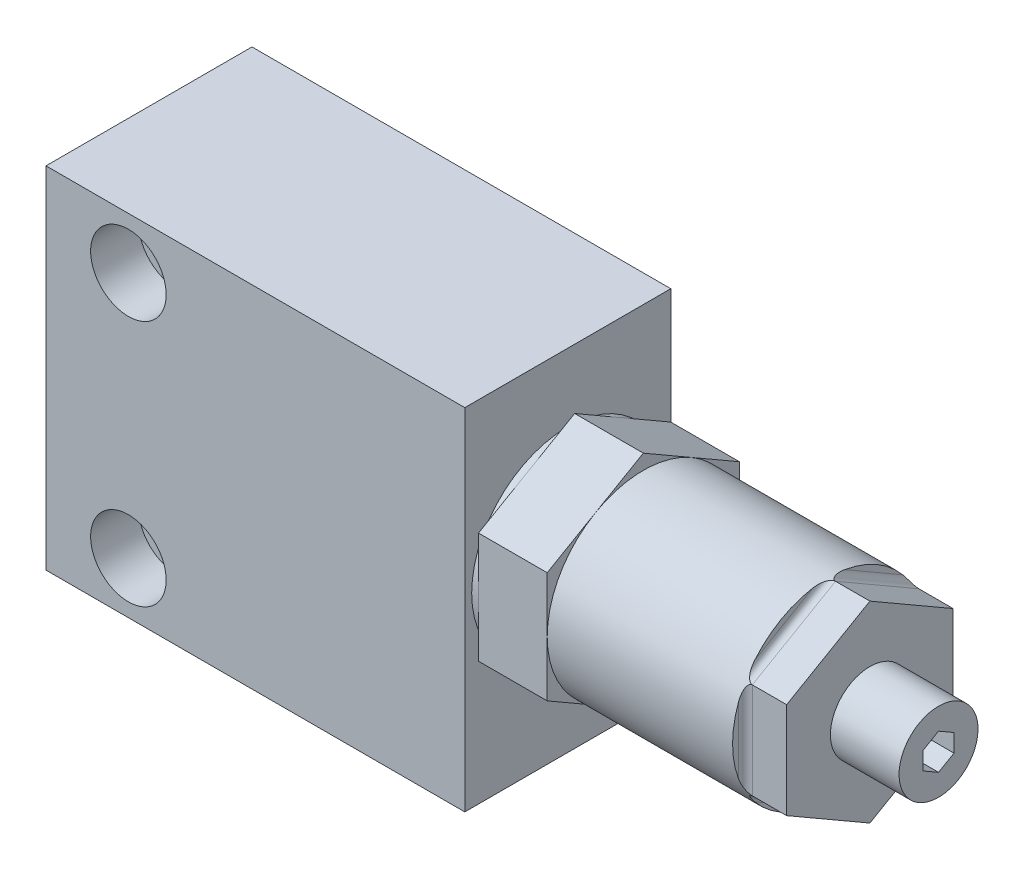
ISO-10303-21;
HEADER;
FILE_DESCRIPTION(('STEP AP214'),'2;1');
FILE_NAME('part.step','',(''),(''),'','','');
FILE_SCHEMA(('AUTOMOTIVE_DESIGN { 1 0 10303 214 1 1 1 1 }'));
ENDSEC;
DATA;
#1=APPLICATION_CONTEXT('core data for automotive mechanical design processes');
#2=APPLICATION_PROTOCOL_DEFINITION('international standard','automotive_design',2000,#1);
#3=PRODUCT_CONTEXT('',#1,'mechanical');
#4=PRODUCT('Part','Part','',(#3));
#5=PRODUCT_RELATED_PRODUCT_CATEGORY('part','',(#4));
#6=PRODUCT_DEFINITION_FORMATION('','',#4);
#7=PRODUCT_DEFINITION_CONTEXT('part definition',#1,'design');
#8=PRODUCT_DEFINITION('design','',#6,#7);
#9=PRODUCT_DEFINITION_SHAPE('','',#8);
#10=(LENGTH_UNIT() NAMED_UNIT(*) SI_UNIT(.MILLI.,.METRE.));
#11=(NAMED_UNIT(*) PLANE_ANGLE_UNIT() SI_UNIT($,.RADIAN.));
#12=(NAMED_UNIT(*) SI_UNIT($,.STERADIAN.) SOLID_ANGLE_UNIT());
#13=UNCERTAINTY_MEASURE_WITH_UNIT(LENGTH_MEASURE(1.E-05),#10,'distance_accuracy_value','');
#14=(GEOMETRIC_REPRESENTATION_CONTEXT(3) GLOBAL_UNCERTAINTY_ASSIGNED_CONTEXT((#13)) GLOBAL_UNIT_ASSIGNED_CONTEXT((#10,
#11,#12)) REPRESENTATION_CONTEXT('',''));
#15=CARTESIAN_POINT('',(0.,0.,0.));
#16=DIRECTION('',(0.,0.,1.));
#17=DIRECTION('',(1.,0.,0.));
#18=AXIS2_PLACEMENT_3D('',#15,#16,#17);
#19=CARTESIAN_POINT('',(105.,-23.9060377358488,15.));
#20=DIRECTION('',(1.,0.,0.));
#21=DIRECTION('',(0.,1.,0.));
#22=AXIS2_PLACEMENT_3D('',#19,#20,#21);
#23=PLANE('',#22);
#24=DIRECTION('',(0.,-0.5,-0.866025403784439));
#25=VECTOR('',#24,1.);
#26=CARTESIAN_POINT('',(105.,-47.8040661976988,-2.14388819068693));
#27=LINE('',#26,#25);
#28=CARTESIAN_POINT('',(105.,-30.9060377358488,27.1243556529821));
#29=VERTEX_POINT('',#28);
#30=CARTESIAN_POINT('',(105.,-37.9060377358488,15.));
#31=VERTEX_POINT('',#30);
#32=EDGE_CURVE('E429',#29,#31,#27,.T.);
#33=ORIENTED_EDGE('',*,*,#32,.T.);
#34=DIRECTION('',(0.,0.5,-0.866025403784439));
#35=VECTOR('',#34,1.);
#36=CARTESIAN_POINT('',(105.,-21.0080092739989,-14.2682438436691));
#37=LINE('',#36,#35);
#38=CARTESIAN_POINT('',(105.,-30.9060377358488,2.87564434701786));
#39=VERTEX_POINT('',#38);
#40=EDGE_CURVE('E377',#31,#39,#37,.T.);
#41=ORIENTED_EDGE('',*,*,#40,.T.);
#42=DIRECTION('',(0.,1.,0.));
#43=VECTOR('',#42,1.);
#44=CARTESIAN_POINT('',(105.,-23.9060377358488,2.87564434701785));
#45=LINE('',#44,#43);
#46=CARTESIAN_POINT('',(105.,-16.9060377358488,2.87564434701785));
#47=VERTEX_POINT('',#46);
#48=EDGE_CURVE('E395',#39,#47,#45,.T.);
#49=ORIENTED_EDGE('',*,*,#48,.T.);
#50=DIRECTION('',(0.,0.5,0.866025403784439));
#51=VECTOR('',#50,1.);
#52=CARTESIAN_POINT('',(105.,-26.8040661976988,-14.2682438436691));
#53=LINE('',#52,#51);
#54=CARTESIAN_POINT('',(105.,-9.90603773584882,15.));
#55=VERTEX_POINT('',#54);
#56=EDGE_CURVE('E405',#47,#55,#53,.T.);
#57=ORIENTED_EDGE('',*,*,#56,.T.);
#58=DIRECTION('',(0.,-0.5,0.866025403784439));
#59=VECTOR('',#58,1.);
#60=CARTESIAN_POINT('',(105.,-0.00800927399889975,-2.14388819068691));
#61=LINE('',#60,#59);
#62=CARTESIAN_POINT('',(105.,-16.9060377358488,27.1243556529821));
#63=VERTEX_POINT('',#62);
#64=EDGE_CURVE('E413',#55,#63,#61,.T.);
#65=ORIENTED_EDGE('',*,*,#64,.T.);
#66=DIRECTION('',(0.,-1.,0.));
#67=VECTOR('',#66,1.);
#68=CARTESIAN_POINT('',(105.,-23.9060377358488,27.1243556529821));
#69=LINE('',#68,#67);
#70=EDGE_CURVE('E421',#63,#29,#69,.T.);
#71=ORIENTED_EDGE('',*,*,#70,.T.);
#72=EDGE_LOOP('',(#33,#41,#49,#57,#65,#71));
#73=FACE_BOUND('',#72,.T.);
#74=CARTESIAN_POINT('',(105.,-23.9060377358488,15.));
#75=DIRECTION('',(1.,0.,0.));
#76=DIRECTION('',(0.,1.,0.));
#77=AXIS2_PLACEMENT_3D('',#74,#75,#76);
#78=CIRCLE('',#77,5.75);
#79=CARTESIAN_POINT('',(105.,-18.1560377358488,15.));
#80=VERTEX_POINT('',#79);
#81=EDGE_CURVE('E313',#80,#80,#78,.T.);
#82=ORIENTED_EDGE('',*,*,#81,.F.);
#83=EDGE_LOOP('',(#82));
#84=FACE_BOUND('',#83,.T.);
#85=ADVANCED_FACE('F37',(#73,#84),#23,.T.);
#86=CARTESIAN_POINT('',(105.,-23.9060377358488,15.));
#87=DIRECTION('',(-1.,0.,0.));
#88=DIRECTION('',(0.,-1.,0.));
#89=AXIS2_PLACEMENT_3D('',#86,#87,#88);
#90=CYLINDRICAL_SURFACE('',#89,14.);
#91=CARTESIAN_POINT('',(61.,-23.9060377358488,15.));
#92=DIRECTION('',(-1.,0.,0.));
#93=DIRECTION('',(0.,-1.,0.));
#94=AXIS2_PLACEMENT_3D('',#91,#92,#93);
#95=CIRCLE('',#94,14.);
#96=CARTESIAN_POINT('',(61.,-37.9060377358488,15.));
#97=VERTEX_POINT('',#96);
#98=EDGE_CURVE('E513',#97,#97,#95,.F.);
#99=ORIENTED_EDGE('',*,*,#98,.T.);
#100=EDGE_LOOP('',(#99));
#101=FACE_BOUND('',#100,.T.);
#102=CARTESIAN_POINT('',(62.,-23.9060377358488,15.));
#103=DIRECTION('',(1.,0.,0.));
#104=DIRECTION('',(0.,0.,-1.));
#105=AXIS2_PLACEMENT_3D('',#102,#103,#104);
#106=CIRCLE('',#105,14.);
#107=CARTESIAN_POINT('',(62.,-23.9060377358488,0.999999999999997));
#108=VERTEX_POINT('',#107);
#109=CARTESIAN_POINT('',(62.,-11.7816820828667,7.99999999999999));
#110=VERTEX_POINT('',#109);
#111=EDGE_CURVE('E12',#108,#110,#106,.T.);
#112=ORIENTED_EDGE('',*,*,#111,.F.);
#113=CARTESIAN_POINT('',(62.,-36.030393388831,8.));
#114=VERTEX_POINT('',#113);
#115=EDGE_CURVE('E42',#114,#108,#106,.T.);
#116=ORIENTED_EDGE('',*,*,#115,.F.);
#117=CARTESIAN_POINT('',(62.,-36.030393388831,22.));
#118=VERTEX_POINT('',#117);
#119=EDGE_CURVE('E657',#118,#114,#106,.T.);
#120=ORIENTED_EDGE('',*,*,#119,.F.);
#121=CARTESIAN_POINT('',(62.,-23.9060377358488,29.));
#122=VERTEX_POINT('',#121);
#123=EDGE_CURVE('E682',#122,#118,#106,.T.);
#124=ORIENTED_EDGE('',*,*,#123,.F.);
#125=CARTESIAN_POINT('',(62.,-11.7816820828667,22.));
#126=VERTEX_POINT('',#125);
#127=EDGE_CURVE('E62',#126,#122,#106,.T.);
#128=ORIENTED_EDGE('',*,*,#127,.F.);
#129=EDGE_CURVE('E47',#110,#126,#106,.T.);
#130=ORIENTED_EDGE('',*,*,#129,.F.);
#131=EDGE_LOOP('',(#112,#116,#120,#124,#128,#130));
#132=FACE_BOUND('',#131,.T.);
#133=ADVANCED_FACE('F721',(#101,#132),#90,.T.);
#134=CARTESIAN_POINT('',(61.,0.,30.));
#135=DIRECTION('',(-1.,0.,0.));
#136=DIRECTION('',(0.,-1.,0.));
#137=AXIS2_PLACEMENT_3D('',#134,#135,#136);
#138=PLANE('',#137);
#139=DIRECTION('',(0.,1.,0.));
#140=VECTOR('',#139,1.);
#141=CARTESIAN_POINT('',(61.,0.,0.));
#142=LINE('',#141,#140);
#143=CARTESIAN_POINT('',(61.,-51.,0.));
#144=VERTEX_POINT('',#143);
#145=CARTESIAN_POINT('',(61.,0.,0.));
#146=VERTEX_POINT('',#145);
#147=EDGE_CURVE('E499',#144,#146,#142,.T.);
#148=ORIENTED_EDGE('',*,*,#147,.T.);
#149=DIRECTION('',(0.,0.,-1.));
#150=VECTOR('',#149,1.);
#151=CARTESIAN_POINT('',(61.,0.,30.));
#152=LINE('',#151,#150);
#153=CARTESIAN_POINT('',(61.,0.,30.));
#154=VERTEX_POINT('',#153);
#155=EDGE_CURVE('E504',#154,#146,#152,.T.);
#156=ORIENTED_EDGE('',*,*,#155,.F.);
#157=DIRECTION('',(0.,1.,0.));
#158=VECTOR('',#157,1.);
#159=CARTESIAN_POINT('',(61.,0.,30.));
#160=LINE('',#159,#158);
#161=CARTESIAN_POINT('',(61.,-51.,30.));
#162=VERTEX_POINT('',#161);
#163=EDGE_CURVE('E490',#162,#154,#160,.T.);
#164=ORIENTED_EDGE('',*,*,#163,.F.);
#165=DIRECTION('',(0.,0.,-1.));
#166=VECTOR('',#165,1.);
#167=CARTESIAN_POINT('',(61.,-51.,30.));
#168=LINE('',#167,#166);
#169=EDGE_CURVE('E507',#162,#144,#168,.T.);
#170=ORIENTED_EDGE('',*,*,#169,.T.);
#171=EDGE_LOOP('',(#148,#156,#164,#170));
#172=FACE_BOUND('',#171,.T.);
#173=ORIENTED_EDGE('',*,*,#98,.F.);
#174=EDGE_LOOP('',(#173));
#175=FACE_BOUND('',#174,.T.);
#176=ADVANCED_FACE('F745',(#172,#175),#138,.F.);
#177=CARTESIAN_POINT('',(0.,0.,30.));
#178=DIRECTION('',(1.,0.,0.));
#179=DIRECTION('',(0.,1.,0.));
#180=AXIS2_PLACEMENT_3D('',#177,#178,#179);
#181=PLANE('',#180);
#182=CARTESIAN_POINT('',(0.,-23.9060377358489,15.));
#183=DIRECTION('',(-1.,0.,0.));
#184=DIRECTION('',(0.,-1.,0.));
#185=AXIS2_PLACEMENT_3D('',#182,#183,#184);
#186=CIRCLE('',#185,7.);
#187=CARTESIAN_POINT('',(0.,-30.9060377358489,15.));
#188=VERTEX_POINT('',#187);
#189=EDGE_CURVE('E438',#188,#188,#186,.T.);
#190=ORIENTED_EDGE('',*,*,#189,.F.);
#191=EDGE_LOOP('',(#190));
#192=FACE_BOUND('',#191,.T.);
#193=DIRECTION('',(0.,-1.,0.));
#194=VECTOR('',#193,1.);
#195=CARTESIAN_POINT('',(0.,0.,0.));
#196=LINE('',#195,#194);
#197=CARTESIAN_POINT('',(0.,0.,0.));
#198=VERTEX_POINT('',#197);
#199=CARTESIAN_POINT('',(0.,-51.,0.));
#200=VERTEX_POINT('',#199);
#201=EDGE_CURVE('E483',#198,#200,#196,.T.);
#202=ORIENTED_EDGE('',*,*,#201,.T.);
#203=DIRECTION('',(0.,0.,-1.));
#204=VECTOR('',#203,1.);
#205=CARTESIAN_POINT('',(0.,-51.,30.));
#206=LINE('',#205,#204);
#207=CARTESIAN_POINT('',(0.,-51.,30.));
#208=VERTEX_POINT('',#207);
#209=EDGE_CURVE('E510',#208,#200,#206,.T.);
#210=ORIENTED_EDGE('',*,*,#209,.F.);
#211=DIRECTION('',(0.,-1.,0.));
#212=VECTOR('',#211,1.);
#213=CARTESIAN_POINT('',(0.,0.,30.));
#214=LINE('',#213,#212);
#215=CARTESIAN_POINT('',(0.,0.,30.));
#216=VERTEX_POINT('',#215);
#217=EDGE_CURVE('E484',#216,#208,#214,.T.);
#218=ORIENTED_EDGE('',*,*,#217,.F.);
#219=DIRECTION('',(0.,0.,-1.));
#220=VECTOR('',#219,1.);
#221=CARTESIAN_POINT('',(0.,0.,30.));
#222=LINE('',#221,#220);
#223=EDGE_CURVE('E494',#216,#198,#222,.T.);
#224=ORIENTED_EDGE('',*,*,#223,.T.);
#225=EDGE_LOOP('',(#202,#210,#218,#224));
#226=FACE_BOUND('',#225,.T.);
#227=ADVANCED_FACE('F549',(#192,#226),#181,.F.);
#228=CARTESIAN_POINT('',(0.,-51.,30.));
#229=DIRECTION('',(0.,1.,0.));
#230=DIRECTION('',(0.,0.,1.));
#231=AXIS2_PLACEMENT_3D('',#228,#229,#230);
#232=PLANE('',#231);
#233=CARTESIAN_POINT('',(35.5,-51.,15.));
#234=DIRECTION('',(0.,-1.,0.));
#235=DIRECTION('',(0.,0.,-1.));
#236=AXIS2_PLACEMENT_3D('',#233,#234,#235);
#237=CIRCLE('',#236,7.);
#238=CARTESIAN_POINT('',(35.5,-51.,8.));
#239=VERTEX_POINT('',#238);
#240=EDGE_CURVE('E450',#239,#239,#237,.T.);
#241=ORIENTED_EDGE('',*,*,#240,.F.);
#242=EDGE_LOOP('',(#241));
#243=FACE_BOUND('',#242,.T.);
#244=DIRECTION('',(1.,0.,0.));
#245=VECTOR('',#244,1.);
#246=CARTESIAN_POINT('',(0.,-51.,0.));
#247=LINE('',#246,#245);
#248=EDGE_CURVE('E497',#200,#144,#247,.T.);
#249=ORIENTED_EDGE('',*,*,#248,.T.);
#250=ORIENTED_EDGE('',*,*,#169,.F.);
#251=DIRECTION('',(1.,0.,0.));
#252=VECTOR('',#251,1.);
#253=CARTESIAN_POINT('',(0.,-51.,30.));
#254=LINE('',#253,#252);
#255=EDGE_CURVE('E487',#208,#162,#254,.T.);
#256=ORIENTED_EDGE('',*,*,#255,.F.);
#257=ORIENTED_EDGE('',*,*,#209,.T.);
#258=EDGE_LOOP('',(#249,#250,#256,#257));
#259=FACE_BOUND('',#258,.T.);
#260=ADVANCED_FACE('F1108',(#243,#259),#232,.F.);
#261=CARTESIAN_POINT('',(0.,0.,30.));
#262=DIRECTION('',(0.,-1.,0.));
#263=DIRECTION('',(0.,0.,-1.));
#264=AXIS2_PLACEMENT_3D('',#261,#262,#263);
#265=PLANE('',#264);
#266=DIRECTION('',(-1.,0.,0.));
#267=VECTOR('',#266,1.);
#268=CARTESIAN_POINT('',(0.,0.,0.));
#269=LINE('',#268,#267);
#270=EDGE_CURVE('E488',#146,#198,#269,.T.);
#271=ORIENTED_EDGE('',*,*,#270,.T.);
#272=ORIENTED_EDGE('',*,*,#223,.F.);
#273=DIRECTION('',(-1.,0.,0.));
#274=VECTOR('',#273,1.);
#275=CARTESIAN_POINT('',(0.,0.,30.));
#276=LINE('',#275,#274);
#277=EDGE_CURVE('E492',#154,#216,#276,.T.);
#278=ORIENTED_EDGE('',*,*,#277,.F.);
#279=ORIENTED_EDGE('',*,*,#155,.T.);
#280=EDGE_LOOP('',(#271,#272,#278,#279));
#281=FACE_BOUND('',#280,.T.);
#282=ADVANCED_FACE('F1139',(#281),#265,.F.);
#283=CARTESIAN_POINT('',(0.,-51.,30.));
#284=DIRECTION('',(0.,0.,1.));
#285=DIRECTION('',(1.,0.,0.));
#286=AXIS2_PLACEMENT_3D('',#283,#284,#285);
#287=PLANE('',#286);
#288=CARTESIAN_POINT('',(12.,-43.5,30.));
#289=DIRECTION('',(0.,0.,1.));
#290=DIRECTION('',(1.,0.,0.));
#291=AXIS2_PLACEMENT_3D('',#288,#289,#290);
#292=CIRCLE('',#291,5.49999999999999);
#293=CARTESIAN_POINT('',(17.5,-43.5,30.));
#294=VERTEX_POINT('',#293);
#295=EDGE_CURVE('E456',#294,#294,#292,.T.);
#296=ORIENTED_EDGE('',*,*,#295,.F.);
#297=EDGE_LOOP('',(#296));
#298=FACE_BOUND('',#297,.T.);
#299=CARTESIAN_POINT('',(12.,-7.5,30.));
#300=DIRECTION('',(0.,0.,1.));
#301=DIRECTION('',(1.,0.,0.));
#302=AXIS2_PLACEMENT_3D('',#299,#300,#301);
#303=CIRCLE('',#302,5.49999999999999);
#304=CARTESIAN_POINT('',(17.5,-7.5,30.));
#305=VERTEX_POINT('',#304);
#306=EDGE_CURVE('E468',#305,#305,#303,.T.);
#307=ORIENTED_EDGE('',*,*,#306,.F.);
#308=EDGE_LOOP('',(#307));
#309=FACE_BOUND('',#308,.T.);
#310=ORIENTED_EDGE('',*,*,#217,.T.);
#311=ORIENTED_EDGE('',*,*,#255,.T.);
#312=ORIENTED_EDGE('',*,*,#163,.T.);
#313=ORIENTED_EDGE('',*,*,#277,.T.);
#314=EDGE_LOOP('',(#310,#311,#312,#313));
#315=FACE_BOUND('',#314,.T.);
#316=ADVANCED_FACE('F1193',(#298,#309,#315),#287,.T.);
#317=CARTESIAN_POINT('',(0.,-51.,0.));
#318=DIRECTION('',(0.,0.,1.));
#319=DIRECTION('',(1.,0.,0.));
#320=AXIS2_PLACEMENT_3D('',#317,#318,#319);
#321=PLANE('',#320);
#322=CARTESIAN_POINT('',(12.,-43.5,0.));
#323=DIRECTION('',(0.,0.,1.));
#324=DIRECTION('',(1.,0.,0.));
#325=AXIS2_PLACEMENT_3D('',#322,#323,#324);
#326=CIRCLE('',#325,3.29999999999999);
#327=CARTESIAN_POINT('',(15.3,-43.5,0.));
#328=VERTEX_POINT('',#327);
#329=EDGE_CURVE('E465',#328,#328,#326,.T.);
#330=ORIENTED_EDGE('',*,*,#329,.T.);
#331=EDGE_LOOP('',(#330));
#332=FACE_BOUND('',#331,.T.);
#333=CARTESIAN_POINT('',(12.,-7.5,0.));
#334=DIRECTION('',(0.,0.,1.));
#335=DIRECTION('',(1.,0.,0.));
#336=AXIS2_PLACEMENT_3D('',#333,#334,#335);
#337=CIRCLE('',#336,3.29999999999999);
#338=CARTESIAN_POINT('',(15.3,-7.5,0.));
#339=VERTEX_POINT('',#338);
#340=EDGE_CURVE('E477',#339,#339,#337,.T.);
#341=ORIENTED_EDGE('',*,*,#340,.T.);
#342=EDGE_LOOP('',(#341));
#343=FACE_BOUND('',#342,.T.);
#344=ORIENTED_EDGE('',*,*,#201,.F.);
#345=ORIENTED_EDGE('',*,*,#270,.F.);
#346=ORIENTED_EDGE('',*,*,#147,.F.);
#347=ORIENTED_EDGE('',*,*,#248,.F.);
#348=EDGE_LOOP('',(#344,#345,#346,#347));
#349=FACE_BOUND('',#348,.T.);
#350=ADVANCED_FACE('F762',(#332,#343,#349),#321,.F.);
#351=CARTESIAN_POINT('',(12.,-7.5,30.));
#352=DIRECTION('',(0.,0.,1.));
#353=DIRECTION('',(1.,0.,0.));
#354=AXIS2_PLACEMENT_3D('',#351,#352,#353);
#355=CYLINDRICAL_SURFACE('',#354,3.3);
#356=ORIENTED_EDGE('',*,*,#340,.F.);
#357=EDGE_LOOP('',(#356));
#358=FACE_BOUND('',#357,.T.);
#359=CARTESIAN_POINT('',(12.,-7.5,23.));
#360=DIRECTION('',(0.,0.,1.));
#361=DIRECTION('',(1.,0.,0.));
#362=AXIS2_PLACEMENT_3D('',#359,#360,#361);
#363=CIRCLE('',#362,3.3);
#364=CARTESIAN_POINT('',(15.3,-7.5,23.));
#365=VERTEX_POINT('',#364);
#366=EDGE_CURVE('E474',#365,#365,#363,.T.);
#367=ORIENTED_EDGE('',*,*,#366,.T.);
#368=EDGE_LOOP('',(#367));
#369=FACE_BOUND('',#368,.T.);
#370=ADVANCED_FACE('F758',(#358,#369),#355,.F.);
#371=CARTESIAN_POINT('',(15.3,-7.5,23.));
#372=DIRECTION('',(0.,0.,-1.));
#373=DIRECTION('',(-1.,0.,0.));
#374=AXIS2_PLACEMENT_3D('',#371,#372,#373);
#375=PLANE('',#374);
#376=ORIENTED_EDGE('',*,*,#366,.F.);
#377=EDGE_LOOP('',(#376));
#378=FACE_BOUND('',#377,.T.);
#379=CARTESIAN_POINT('',(12.,-7.5,23.));
#380=DIRECTION('',(0.,0.,1.));
#381=DIRECTION('',(1.,0.,0.));
#382=AXIS2_PLACEMENT_3D('',#379,#380,#381);
#383=CIRCLE('',#382,5.5);
#384=CARTESIAN_POINT('',(17.5,-7.5,23.));
#385=VERTEX_POINT('',#384);
#386=EDGE_CURVE('E471',#385,#385,#383,.T.);
#387=ORIENTED_EDGE('',*,*,#386,.T.);
#388=EDGE_LOOP('',(#387));
#389=FACE_BOUND('',#388,.T.);
#390=ADVANCED_FACE('F761',(#378,#389),#375,.F.);
#391=CARTESIAN_POINT('',(12.,-7.5,30.));
#392=DIRECTION('',(0.,0.,1.));
#393=DIRECTION('',(1.,0.,0.));
#394=AXIS2_PLACEMENT_3D('',#391,#392,#393);
#395=CYLINDRICAL_SURFACE('',#394,5.5);
#396=ORIENTED_EDGE('',*,*,#386,.F.);
#397=EDGE_LOOP('',(#396));
#398=FACE_BOUND('',#397,.T.);
#399=ORIENTED_EDGE('',*,*,#306,.T.);
#400=EDGE_LOOP('',(#399));
#401=FACE_BOUND('',#400,.T.);
#402=ADVANCED_FACE('F766',(#398,#401),#395,.F.);
#403=CARTESIAN_POINT('',(12.,-43.5,30.));
#404=DIRECTION('',(0.,0.,1.));
#405=DIRECTION('',(1.,0.,0.));
#406=AXIS2_PLACEMENT_3D('',#403,#404,#405);
#407=CYLINDRICAL_SURFACE('',#406,3.3);
#408=ORIENTED_EDGE('',*,*,#329,.F.);
#409=EDGE_LOOP('',(#408));
#410=FACE_BOUND('',#409,.T.);
#411=CARTESIAN_POINT('',(12.,-43.5,23.));
#412=DIRECTION('',(0.,0.,1.));
#413=DIRECTION('',(1.,0.,0.));
#414=AXIS2_PLACEMENT_3D('',#411,#412,#413);
#415=CIRCLE('',#414,3.3);
#416=CARTESIAN_POINT('',(15.3,-43.5,23.));
#417=VERTEX_POINT('',#416);
#418=EDGE_CURVE('E462',#417,#417,#415,.T.);
#419=ORIENTED_EDGE('',*,*,#418,.T.);
#420=EDGE_LOOP('',(#419));
#421=FACE_BOUND('',#420,.T.);
#422=ADVANCED_FACE('F770',(#410,#421),#407,.F.);
#423=CARTESIAN_POINT('',(15.3,-43.5,23.));
#424=DIRECTION('',(0.,0.,-1.));
#425=DIRECTION('',(-1.,0.,0.));
#426=AXIS2_PLACEMENT_3D('',#423,#424,#425);
#427=PLANE('',#426);
#428=ORIENTED_EDGE('',*,*,#418,.F.);
#429=EDGE_LOOP('',(#428));
#430=FACE_BOUND('',#429,.T.);
#431=CARTESIAN_POINT('',(12.,-43.5,23.));
#432=DIRECTION('',(0.,0.,1.));
#433=DIRECTION('',(1.,0.,0.));
#434=AXIS2_PLACEMENT_3D('',#431,#432,#433);
#435=CIRCLE('',#434,5.5);
#436=CARTESIAN_POINT('',(17.5,-43.5,23.));
#437=VERTEX_POINT('',#436);
#438=EDGE_CURVE('E459',#437,#437,#435,.T.);
#439=ORIENTED_EDGE('',*,*,#438,.T.);
#440=EDGE_LOOP('',(#439));
#441=FACE_BOUND('',#440,.T.);
#442=ADVANCED_FACE('F774',(#430,#441),#427,.F.);
#443=CARTESIAN_POINT('',(12.,-43.5,30.));
#444=DIRECTION('',(0.,0.,1.));
#445=DIRECTION('',(1.,0.,0.));
#446=AXIS2_PLACEMENT_3D('',#443,#444,#445);
#447=CYLINDRICAL_SURFACE('',#446,5.5);
#448=ORIENTED_EDGE('',*,*,#438,.F.);
#449=EDGE_LOOP('',(#448));
#450=FACE_BOUND('',#449,.T.);
#451=ORIENTED_EDGE('',*,*,#295,.T.);
#452=EDGE_LOOP('',(#451));
#453=FACE_BOUND('',#452,.T.);
#454=ADVANCED_FACE('F778',(#450,#453),#447,.F.);
#455=CARTESIAN_POINT('',(35.5,-49.5,15.));
#456=DIRECTION('',(0.,-1.,0.));
#457=DIRECTION('',(0.,0.,-1.));
#458=AXIS2_PLACEMENT_3D('',#455,#456,#457);
#459=PLANE('',#458);
#460=CARTESIAN_POINT('',(35.5,-49.5,15.));
#461=DIRECTION('',(0.,-1.,0.));
#462=DIRECTION('',(0.,0.,-1.));
#463=AXIS2_PLACEMENT_3D('',#460,#461,#462);
#464=CIRCLE('',#463,7.);
#465=CARTESIAN_POINT('',(35.5,-49.5,8.));
#466=VERTEX_POINT('',#465);
#467=EDGE_CURVE('E446',#466,#466,#464,.T.);
#468=ORIENTED_EDGE('',*,*,#467,.T.);
#469=EDGE_LOOP('',(#468));
#470=FACE_BOUND('',#469,.T.);
#471=CARTESIAN_POINT('',(35.5,-49.5,15.));
#472=DIRECTION('',(0.,-1.,0.));
#473=DIRECTION('',(0.,0.,-1.));
#474=AXIS2_PLACEMENT_3D('',#471,#472,#473);
#475=CIRCLE('',#474,5.72249999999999);
#476=CARTESIAN_POINT('',(35.5,-49.5,9.27750000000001));
#477=VERTEX_POINT('',#476);
#478=EDGE_CURVE('E449',#477,#477,#475,.F.);
#479=ORIENTED_EDGE('',*,*,#478,.T.);
#480=EDGE_LOOP('',(#479));
#481=FACE_BOUND('',#480,.T.);
#482=ADVANCED_FACE('F782',(#470,#481),#459,.T.);
#483=CARTESIAN_POINT('',(35.5,-49.5,15.));
#484=DIRECTION('',(0.,-1.,0.));
#485=DIRECTION('',(0.,0.,-1.));
#486=AXIS2_PLACEMENT_3D('',#483,#484,#485);
#487=CYLINDRICAL_SURFACE('',#486,7.);
#488=ORIENTED_EDGE('',*,*,#467,.F.);
#489=EDGE_LOOP('',(#488));
#490=FACE_BOUND('',#489,.T.);
#491=ORIENTED_EDGE('',*,*,#240,.T.);
#492=EDGE_LOOP('',(#491));
#493=FACE_BOUND('',#492,.T.);
#494=ADVANCED_FACE('F788',(#490,#493),#487,.F.);
#495=CARTESIAN_POINT('',(35.5,-31.99,15.));
#496=DIRECTION('',(0.,-1.,0.));
#497=DIRECTION('',(0.,0.,-1.));
#498=AXIS2_PLACEMENT_3D('',#495,#496,#497);
#499=CONICAL_SURFACE('',#498,5.72249999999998,1.02974425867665);
#500=CARTESIAN_POINT('',(35.5,-28.5515751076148,15.));
#501=VERTEX_POINT('',#500);
#502=VERTEX_LOOP('',#501);
#503=FACE_BOUND('',#502,.T.);
#504=CARTESIAN_POINT('',(35.5,-31.99,15.));
#505=DIRECTION('',(0.,-1.,0.));
#506=DIRECTION('',(0.,0.,-1.));
#507=AXIS2_PLACEMENT_3D('',#504,#505,#506);
#508=CIRCLE('',#507,5.72249999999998);
#509=CARTESIAN_POINT('',(35.5,-31.99,9.27750000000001));
#510=VERTEX_POINT('',#509);
#511=EDGE_CURVE('E453',#510,#510,#508,.T.);
#512=ORIENTED_EDGE('',*,*,#511,.T.);
#513=EDGE_LOOP('',(#512));
#514=FACE_BOUND('',#513,.T.);
#515=ADVANCED_FACE('F784',(#503,#514),#499,.F.);
#516=CARTESIAN_POINT('',(35.5,-51.,15.));
#517=DIRECTION('',(0.,-1.,0.));
#518=DIRECTION('',(0.,0.,-1.));
#519=AXIS2_PLACEMENT_3D('',#516,#517,#518);
#520=CYLINDRICAL_SURFACE('',#519,5.72249999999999);
#521=ORIENTED_EDGE('',*,*,#511,.F.);
#522=EDGE_LOOP('',(#521));
#523=FACE_BOUND('',#522,.T.);
#524=ORIENTED_EDGE('',*,*,#478,.F.);
#525=EDGE_LOOP('',(#524));
#526=FACE_BOUND('',#525,.T.);
#527=ADVANCED_FACE('F787',(#523,#526),#520,.F.);
#528=CARTESIAN_POINT('',(1.5,-23.9060377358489,15.));
#529=DIRECTION('',(-1.,0.,0.));
#530=DIRECTION('',(0.,-1.,0.));
#531=AXIS2_PLACEMENT_3D('',#528,#529,#530);
#532=PLANE('',#531);
#533=CARTESIAN_POINT('',(1.5,-23.9060377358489,15.));
#534=DIRECTION('',(-1.,0.,0.));
#535=DIRECTION('',(0.,-1.,0.));
#536=AXIS2_PLACEMENT_3D('',#533,#534,#535);
#537=CIRCLE('',#536,7.);
#538=CARTESIAN_POINT('',(1.5,-30.9060377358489,15.));
#539=VERTEX_POINT('',#538);
#540=EDGE_CURVE('E440',#539,#539,#537,.T.);
#541=ORIENTED_EDGE('',*,*,#540,.T.);
#542=EDGE_LOOP('',(#541));
#543=FACE_BOUND('',#542,.T.);
#544=CARTESIAN_POINT('',(1.5,-23.9060377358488,15.));
#545=DIRECTION('',(-1.,0.,0.));
#546=DIRECTION('',(0.,-1.,0.));
#547=AXIS2_PLACEMENT_3D('',#544,#545,#546);
#548=CIRCLE('',#547,5.7225);
#549=CARTESIAN_POINT('',(1.5,-29.6285377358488,15.));
#550=VERTEX_POINT('',#549);
#551=EDGE_CURVE('E443',#550,#550,#548,.F.);
#552=ORIENTED_EDGE('',*,*,#551,.T.);
#553=EDGE_LOOP('',(#552));
#554=FACE_BOUND('',#553,.T.);
#555=ADVANCED_FACE('F792',(#543,#554),#532,.T.);
#556=CARTESIAN_POINT('',(1.5,-23.9060377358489,15.));
#557=DIRECTION('',(-1.,0.,0.));
#558=DIRECTION('',(0.,-1.,0.));
#559=AXIS2_PLACEMENT_3D('',#556,#557,#558);
#560=CYLINDRICAL_SURFACE('',#559,7.);
#561=ORIENTED_EDGE('',*,*,#540,.F.);
#562=EDGE_LOOP('',(#561));
#563=FACE_BOUND('',#562,.T.);
#564=ORIENTED_EDGE('',*,*,#189,.T.);
#565=EDGE_LOOP('',(#564));
#566=FACE_BOUND('',#565,.T.);
#567=ADVANCED_FACE('F753',(#563,#566),#560,.F.);
#568=CARTESIAN_POINT('',(19.01,-23.9060377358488,15.));
#569=DIRECTION('',(-1.,0.,0.));
#570=DIRECTION('',(0.,0.,1.));
#571=AXIS2_PLACEMENT_3D('',#568,#569,#570);
#572=CONICAL_SURFACE('',#571,5.72249999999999,1.02974425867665);
#573=CARTESIAN_POINT('',(22.4484248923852,-23.9060377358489,15.));
#574=VERTEX_POINT('',#573);
#575=VERTEX_LOOP('',#574);
#576=FACE_BOUND('',#575,.T.);
#577=CARTESIAN_POINT('',(19.01,-23.9060377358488,15.));
#578=DIRECTION('',(-1.,0.,0.));
#579=DIRECTION('',(0.,0.,1.));
#580=AXIS2_PLACEMENT_3D('',#577,#578,#579);
#581=CIRCLE('',#580,5.72249999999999);
#582=CARTESIAN_POINT('',(19.01,-23.9060377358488,20.7225));
#583=VERTEX_POINT('',#582);
#584=EDGE_CURVE('E480',#583,#583,#581,.T.);
#585=ORIENTED_EDGE('',*,*,#584,.T.);
#586=EDGE_LOOP('',(#585));
#587=FACE_BOUND('',#586,.T.);
#588=ADVANCED_FACE('F749',(#576,#587),#572,.F.);
#589=CARTESIAN_POINT('',(0.,-23.9060377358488,15.));
#590=DIRECTION('',(-1.,0.,0.));
#591=DIRECTION('',(0.,0.,1.));
#592=AXIS2_PLACEMENT_3D('',#589,#590,#591);
#593=CYLINDRICAL_SURFACE('',#592,5.7225);
#594=ORIENTED_EDGE('',*,*,#584,.F.);
#595=EDGE_LOOP('',(#594));
#596=FACE_BOUND('',#595,.T.);
#597=ORIENTED_EDGE('',*,*,#551,.F.);
#598=EDGE_LOOP('',(#597));
#599=FACE_BOUND('',#598,.T.);
#600=ADVANCED_FACE('F752',(#596,#599),#593,.F.);
#601=CARTESIAN_POINT('',(62.,-15.8231339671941,0.999999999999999));
#602=DIRECTION('',(0.,0.866025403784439,-0.5));
#603=DIRECTION('',(0.,0.5,0.866025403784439));
#604=AXIS2_PLACEMENT_3D('',#601,#602,#603);
#605=PLANE('',#604);
#606=DIRECTION('',(0.,0.5,0.866025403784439));
#607=VECTOR('',#606,1.);
#608=CARTESIAN_POINT('',(62.,-15.8231339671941,0.999999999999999));
#609=LINE('',#608,#607);
#610=CARTESIAN_POINT('',(62.,-15.8231339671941,0.999999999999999));
#611=VERTEX_POINT('',#610);
#612=EDGE_CURVE('E327',#611,#110,#609,.T.);
#613=ORIENTED_EDGE('',*,*,#612,.T.);
#614=CARTESIAN_POINT('',(62.,-7.74023019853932,15.));
#615=VERTEX_POINT('',#614);
#616=EDGE_CURVE('E331',#110,#615,#609,.T.);
#617=ORIENTED_EDGE('',*,*,#616,.T.);
#618=DIRECTION('',(1.,0.,0.));
#619=VECTOR('',#618,1.);
#620=CARTESIAN_POINT('',(62.,-7.74023019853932,15.));
#621=LINE('',#620,#619);
#622=CARTESIAN_POINT('',(72.,-7.74023019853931,15.));
#623=VERTEX_POINT('',#622);
#624=EDGE_CURVE('E351',#615,#623,#621,.T.);
#625=ORIENTED_EDGE('',*,*,#624,.T.);
#626=DIRECTION('',(0.,0.5,0.866025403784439));
#627=VECTOR('',#626,1.);
#628=CARTESIAN_POINT('',(72.,-15.8231339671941,0.999999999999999));
#629=LINE('',#628,#627);
#630=CARTESIAN_POINT('',(72.,-11.7816820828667,8.));
#631=VERTEX_POINT('',#630);
#632=EDGE_CURVE('E324',#631,#623,#629,.T.);
#633=ORIENTED_EDGE('',*,*,#632,.F.);
#634=CARTESIAN_POINT('',(72.,-15.8231339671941,0.999999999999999));
#635=VERTEX_POINT('',#634);
#636=EDGE_CURVE('E352',#635,#631,#629,.T.);
#637=ORIENTED_EDGE('',*,*,#636,.F.);
#638=DIRECTION('',(1.,0.,0.));
#639=VECTOR('',#638,1.);
#640=CARTESIAN_POINT('',(62.,-15.8231339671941,0.999999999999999));
#641=LINE('',#640,#639);
#642=EDGE_CURVE('E374',#611,#635,#641,.T.);
#643=ORIENTED_EDGE('',*,*,#642,.F.);
#644=EDGE_LOOP('',(#613,#617,#625,#633,#637,#643));
#645=FACE_BOUND('',#644,.T.);
#646=ADVANCED_FACE('F712',(#645),#605,.T.);
#647=CARTESIAN_POINT('',(62.,-31.9889415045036,0.999999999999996));
#648=DIRECTION('',(0.,0.,-1.));
#649=DIRECTION('',(0.,1.,0.));
#650=AXIS2_PLACEMENT_3D('',#647,#648,#649);
#651=PLANE('',#650);
#652=DIRECTION('',(0.,1.,0.));
#653=VECTOR('',#652,1.);
#654=CARTESIAN_POINT('',(62.,-31.9889415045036,0.999999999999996));
#655=LINE('',#654,#653);
#656=CARTESIAN_POINT('',(62.,-31.9889415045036,0.999999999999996));
#657=VERTEX_POINT('',#656);
#658=EDGE_CURVE('E348',#657,#108,#655,.T.);
#659=ORIENTED_EDGE('',*,*,#658,.T.);
#660=EDGE_CURVE('E347',#108,#611,#655,.T.);
#661=ORIENTED_EDGE('',*,*,#660,.T.);
#662=ORIENTED_EDGE('',*,*,#642,.T.);
#663=DIRECTION('',(0.,1.,0.));
#664=VECTOR('',#663,1.);
#665=CARTESIAN_POINT('',(72.,-31.9889415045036,0.999999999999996));
#666=LINE('',#665,#664);
#667=CARTESIAN_POINT('',(72.,-23.9060377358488,0.999999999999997));
#668=VERTEX_POINT('',#667);
#669=EDGE_CURVE('E371',#668,#635,#666,.T.);
#670=ORIENTED_EDGE('',*,*,#669,.F.);
#671=CARTESIAN_POINT('',(72.,-31.9889415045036,0.999999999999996));
#672=VERTEX_POINT('',#671);
#673=EDGE_CURVE('E372',#672,#668,#666,.T.);
#674=ORIENTED_EDGE('',*,*,#673,.F.);
#675=DIRECTION('',(1.,0.,0.));
#676=VECTOR('',#675,1.);
#677=CARTESIAN_POINT('',(62.,-31.9889415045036,0.999999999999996));
#678=LINE('',#677,#676);
#679=EDGE_CURVE('E378',#657,#672,#678,.T.);
#680=ORIENTED_EDGE('',*,*,#679,.F.);
#681=EDGE_LOOP('',(#659,#661,#662,#670,#674,#680));
#682=FACE_BOUND('',#681,.T.);
#683=ADVANCED_FACE('F705',(#682),#651,.T.);
#684=CARTESIAN_POINT('',(62.,-40.0718452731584,15.));
#685=DIRECTION('',(0.,-0.866025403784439,-0.5));
#686=DIRECTION('',(0.,0.5,-0.866025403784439));
#687=AXIS2_PLACEMENT_3D('',#684,#685,#686);
#688=PLANE('',#687);
#689=DIRECTION('',(0.,0.5,-0.866025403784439));
#690=VECTOR('',#689,1.);
#691=CARTESIAN_POINT('',(62.,-40.0718452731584,15.));
#692=LINE('',#691,#690);
#693=CARTESIAN_POINT('',(62.,-40.0718452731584,15.));
#694=VERTEX_POINT('',#693);
#695=EDGE_CURVE('E344',#694,#114,#692,.T.);
#696=ORIENTED_EDGE('',*,*,#695,.T.);
#697=EDGE_CURVE('E343',#114,#657,#692,.T.);
#698=ORIENTED_EDGE('',*,*,#697,.T.);
#699=ORIENTED_EDGE('',*,*,#679,.T.);
#700=DIRECTION('',(0.,0.5,-0.866025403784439));
#701=VECTOR('',#700,1.);
#702=CARTESIAN_POINT('',(72.,-40.0718452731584,15.));
#703=LINE('',#702,#701);
#704=CARTESIAN_POINT('',(72.,-36.030393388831,8.));
#705=VERTEX_POINT('',#704);
#706=EDGE_CURVE('E367',#705,#672,#703,.T.);
#707=ORIENTED_EDGE('',*,*,#706,.F.);
#708=CARTESIAN_POINT('',(72.,-40.0718452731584,15.));
#709=VERTEX_POINT('',#708);
#710=EDGE_CURVE('E368',#709,#705,#703,.T.);
#711=ORIENTED_EDGE('',*,*,#710,.F.);
#712=DIRECTION('',(1.,0.,0.));
#713=VECTOR('',#712,1.);
#714=CARTESIAN_POINT('',(62.,-40.0718452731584,15.));
#715=LINE('',#714,#713);
#716=EDGE_CURVE('E381',#694,#709,#715,.T.);
#717=ORIENTED_EDGE('',*,*,#716,.F.);
#718=EDGE_LOOP('',(#696,#698,#699,#707,#711,#717));
#719=FACE_BOUND('',#718,.T.);
#720=ADVANCED_FACE('F697',(#719),#688,.T.);
#721=CARTESIAN_POINT('',(62.,-31.9889415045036,29.));
#722=DIRECTION('',(0.,-0.866025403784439,0.5));
#723=DIRECTION('',(0.,-0.5,-0.866025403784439));
#724=AXIS2_PLACEMENT_3D('',#721,#722,#723);
#725=PLANE('',#724);
#726=DIRECTION('',(0.,-0.5,-0.866025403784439));
#727=VECTOR('',#726,1.);
#728=CARTESIAN_POINT('',(62.,-31.9889415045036,29.));
#729=LINE('',#728,#727);
#730=CARTESIAN_POINT('',(62.,-31.9889415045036,29.));
#731=VERTEX_POINT('',#730);
#732=EDGE_CURVE('E340',#731,#118,#729,.T.);
#733=ORIENTED_EDGE('',*,*,#732,.T.);
#734=EDGE_CURVE('E339',#118,#694,#729,.T.);
#735=ORIENTED_EDGE('',*,*,#734,.T.);
#736=ORIENTED_EDGE('',*,*,#716,.T.);
#737=DIRECTION('',(0.,-0.5,-0.866025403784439));
#738=VECTOR('',#737,1.);
#739=CARTESIAN_POINT('',(72.,-31.9889415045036,29.));
#740=LINE('',#739,#738);
#741=CARTESIAN_POINT('',(72.,-36.030393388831,22.));
#742=VERTEX_POINT('',#741);
#743=EDGE_CURVE('E363',#742,#709,#740,.T.);
#744=ORIENTED_EDGE('',*,*,#743,.F.);
#745=CARTESIAN_POINT('',(72.,-31.9889415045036,29.));
#746=VERTEX_POINT('',#745);
#747=EDGE_CURVE('E364',#746,#742,#740,.T.);
#748=ORIENTED_EDGE('',*,*,#747,.F.);
#749=DIRECTION('',(1.,0.,0.));
#750=VECTOR('',#749,1.);
#751=CARTESIAN_POINT('',(62.,-31.9889415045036,29.));
#752=LINE('',#751,#750);
#753=EDGE_CURVE('E384',#731,#746,#752,.T.);
#754=ORIENTED_EDGE('',*,*,#753,.F.);
#755=EDGE_LOOP('',(#733,#735,#736,#744,#748,#754));
#756=FACE_BOUND('',#755,.T.);
#757=ADVANCED_FACE('F689',(#756),#725,.T.);
#758=CARTESIAN_POINT('',(62.,-15.8231339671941,29.));
#759=DIRECTION('',(0.,0.,1.));
#760=DIRECTION('',(0.,-1.,0.));
#761=AXIS2_PLACEMENT_3D('',#758,#759,#760);
#762=PLANE('',#761);
#763=DIRECTION('',(0.,-1.,0.));
#764=VECTOR('',#763,1.);
#765=CARTESIAN_POINT('',(62.,-15.8231339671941,29.));
#766=LINE('',#765,#764);
#767=CARTESIAN_POINT('',(62.,-15.8231339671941,29.));
#768=VERTEX_POINT('',#767);
#769=EDGE_CURVE('E336',#768,#122,#766,.T.);
#770=ORIENTED_EDGE('',*,*,#769,.T.);
#771=EDGE_CURVE('E335',#122,#731,#766,.T.);
#772=ORIENTED_EDGE('',*,*,#771,.T.);
#773=ORIENTED_EDGE('',*,*,#753,.T.);
#774=DIRECTION('',(0.,-1.,0.));
#775=VECTOR('',#774,1.);
#776=CARTESIAN_POINT('',(72.,-15.8231339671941,29.));
#777=LINE('',#776,#775);
#778=CARTESIAN_POINT('',(72.,-23.9060377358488,29.));
#779=VERTEX_POINT('',#778);
#780=EDGE_CURVE('E359',#779,#746,#777,.T.);
#781=ORIENTED_EDGE('',*,*,#780,.F.);
#782=CARTESIAN_POINT('',(72.,-15.8231339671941,29.));
#783=VERTEX_POINT('',#782);
#784=EDGE_CURVE('E360',#783,#779,#777,.T.);
#785=ORIENTED_EDGE('',*,*,#784,.F.);
#786=DIRECTION('',(1.,0.,0.));
#787=VECTOR('',#786,1.);
#788=CARTESIAN_POINT('',(62.,-15.8231339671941,29.));
#789=LINE('',#788,#787);
#790=EDGE_CURVE('E387',#768,#783,#789,.T.);
#791=ORIENTED_EDGE('',*,*,#790,.F.);
#792=EDGE_LOOP('',(#770,#772,#773,#781,#785,#791));
#793=FACE_BOUND('',#792,.T.);
#794=ADVANCED_FACE('F668',(#793),#762,.T.);
#795=CARTESIAN_POINT('',(62.,-7.74023019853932,15.));
#796=DIRECTION('',(0.,0.866025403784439,0.5));
#797=DIRECTION('',(0.,-0.5,0.866025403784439));
#798=AXIS2_PLACEMENT_3D('',#795,#796,#797);
#799=PLANE('',#798);
#800=DIRECTION('',(0.,-0.5,0.866025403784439));
#801=VECTOR('',#800,1.);
#802=CARTESIAN_POINT('',(62.,-7.74023019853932,15.));
#803=LINE('',#802,#801);
#804=EDGE_CURVE('E332',#615,#126,#803,.T.);
#805=ORIENTED_EDGE('',*,*,#804,.T.);
#806=EDGE_CURVE('E330',#126,#768,#803,.T.);
#807=ORIENTED_EDGE('',*,*,#806,.T.);
#808=ORIENTED_EDGE('',*,*,#790,.T.);
#809=DIRECTION('',(0.,-0.5,0.866025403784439));
#810=VECTOR('',#809,1.);
#811=CARTESIAN_POINT('',(72.,-7.74023019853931,15.));
#812=LINE('',#811,#810);
#813=CARTESIAN_POINT('',(72.,-11.7816820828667,22.));
#814=VERTEX_POINT('',#813);
#815=EDGE_CURVE('E355',#814,#783,#812,.T.);
#816=ORIENTED_EDGE('',*,*,#815,.F.);
#817=EDGE_CURVE('E356',#623,#814,#812,.T.);
#818=ORIENTED_EDGE('',*,*,#817,.F.);
#819=ORIENTED_EDGE('',*,*,#624,.F.);
#820=EDGE_LOOP('',(#805,#807,#808,#816,#818,#819));
#821=FACE_BOUND('',#820,.T.);
#822=ADVANCED_FACE('F676',(#821),#799,.T.);
#823=CARTESIAN_POINT('',(62.,-7.74023019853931,15.));
#824=DIRECTION('',(1.,0.,0.));
#825=DIRECTION('',(0.,0.,-1.));
#826=AXIS2_PLACEMENT_3D('',#823,#824,#825);
#827=PLANE('',#826);
#828=ORIENTED_EDGE('',*,*,#660,.F.);
#829=ORIENTED_EDGE('',*,*,#111,.T.);
#830=ORIENTED_EDGE('',*,*,#612,.F.);
#831=EDGE_LOOP('',(#828,#829,#830));
#832=FACE_BOUND('',#831,.T.);
#833=ADVANCED_FACE('F724',(#832),#827,.F.);
#834=ORIENTED_EDGE('',*,*,#616,.F.);
#835=ORIENTED_EDGE('',*,*,#129,.T.);
#836=ORIENTED_EDGE('',*,*,#804,.F.);
#837=EDGE_LOOP('',(#834,#835,#836));
#838=FACE_BOUND('',#837,.T.);
#839=ADVANCED_FACE('F720',(#838),#827,.F.);
#840=ORIENTED_EDGE('',*,*,#806,.F.);
#841=ORIENTED_EDGE('',*,*,#127,.T.);
#842=ORIENTED_EDGE('',*,*,#769,.F.);
#843=EDGE_LOOP('',(#840,#841,#842));
#844=FACE_BOUND('',#843,.T.);
#845=ADVANCED_FACE('F680',(#844),#827,.F.);
#846=ORIENTED_EDGE('',*,*,#771,.F.);
#847=ORIENTED_EDGE('',*,*,#123,.T.);
#848=ORIENTED_EDGE('',*,*,#732,.F.);
#849=EDGE_LOOP('',(#846,#847,#848));
#850=FACE_BOUND('',#849,.T.);
#851=ADVANCED_FACE('F686',(#850),#827,.F.);
#852=ORIENTED_EDGE('',*,*,#734,.F.);
#853=ORIENTED_EDGE('',*,*,#119,.T.);
#854=ORIENTED_EDGE('',*,*,#695,.F.);
#855=EDGE_LOOP('',(#852,#853,#854));
#856=FACE_BOUND('',#855,.T.);
#857=ADVANCED_FACE('F731',(#856),#827,.F.);
#858=ORIENTED_EDGE('',*,*,#697,.F.);
#859=ORIENTED_EDGE('',*,*,#115,.T.);
#860=ORIENTED_EDGE('',*,*,#658,.F.);
#861=EDGE_LOOP('',(#858,#859,#860));
#862=FACE_BOUND('',#861,.T.);
#863=ADVANCED_FACE('F728',(#862),#827,.F.);
#864=CARTESIAN_POINT('',(72.,-7.74023019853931,15.));
#865=DIRECTION('',(1.,0.,0.));
#866=DIRECTION('',(0.,0.,-1.));
#867=AXIS2_PLACEMENT_3D('',#864,#865,#866);
#868=PLANE('',#867);
#869=CARTESIAN_POINT('',(72.,-23.9060377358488,15.));
#870=DIRECTION('',(1.,0.,0.));
#871=DIRECTION('',(0.,0.,-1.));
#872=AXIS2_PLACEMENT_3D('',#869,#870,#871);
#873=CIRCLE('',#872,14.);
#874=EDGE_CURVE('E648',#668,#631,#873,.T.);
#875=ORIENTED_EDGE('',*,*,#874,.F.);
#876=ORIENTED_EDGE('',*,*,#669,.T.);
#877=ORIENTED_EDGE('',*,*,#636,.T.);
#878=EDGE_LOOP('',(#875,#876,#877));
#879=FACE_BOUND('',#878,.T.);
#880=ADVANCED_FACE('F709',(#879),#868,.T.);
#881=EDGE_CURVE('E653',#631,#814,#873,.T.);
#882=ORIENTED_EDGE('',*,*,#881,.F.);
#883=ORIENTED_EDGE('',*,*,#632,.T.);
#884=ORIENTED_EDGE('',*,*,#817,.T.);
#885=EDGE_LOOP('',(#882,#883,#884));
#886=FACE_BOUND('',#885,.T.);
#887=ADVANCED_FACE('F716',(#886),#868,.T.);
#888=EDGE_CURVE('E658',#814,#779,#873,.T.);
#889=ORIENTED_EDGE('',*,*,#888,.F.);
#890=ORIENTED_EDGE('',*,*,#815,.T.);
#891=ORIENTED_EDGE('',*,*,#784,.T.);
#892=EDGE_LOOP('',(#889,#890,#891));
#893=FACE_BOUND('',#892,.T.);
#894=ADVANCED_FACE('F672',(#893),#868,.T.);
#895=EDGE_CURVE('E652',#779,#742,#873,.T.);
#896=ORIENTED_EDGE('',*,*,#895,.F.);
#897=ORIENTED_EDGE('',*,*,#780,.T.);
#898=ORIENTED_EDGE('',*,*,#747,.T.);
#899=EDGE_LOOP('',(#896,#897,#898));
#900=FACE_BOUND('',#899,.T.);
#901=ADVANCED_FACE('F664',(#900),#868,.T.);
#902=EDGE_CURVE('E647',#742,#705,#873,.T.);
#903=ORIENTED_EDGE('',*,*,#902,.F.);
#904=ORIENTED_EDGE('',*,*,#743,.T.);
#905=ORIENTED_EDGE('',*,*,#710,.T.);
#906=EDGE_LOOP('',(#903,#904,#905));
#907=FACE_BOUND('',#906,.T.);
#908=ADVANCED_FACE('F694',(#907),#868,.T.);
#909=EDGE_CURVE('E645',#705,#668,#873,.T.);
#910=ORIENTED_EDGE('',*,*,#909,.F.);
#911=ORIENTED_EDGE('',*,*,#706,.T.);
#912=ORIENTED_EDGE('',*,*,#673,.T.);
#913=EDGE_LOOP('',(#910,#911,#912));
#914=FACE_BOUND('',#913,.T.);
#915=ADVANCED_FACE('F702',(#914),#868,.T.);
#916=CARTESIAN_POINT('',(99.,-23.9060377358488,2.87564434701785));
#917=DIRECTION('',(0.,0.,-1.));
#918=DIRECTION('',(0.,1.,0.));
#919=AXIS2_PLACEMENT_3D('',#916,#917,#918);
#920=PLANE('',#919);
#921=DIRECTION('',(1.,0.,0.));
#922=VECTOR('',#921,1.);
#923=CARTESIAN_POINT('',(99.,-30.9060377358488,2.87564434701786));
#924=LINE('',#923,#922);
#925=CARTESIAN_POINT('',(100.,-30.9060377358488,2.87564434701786));
#926=VERTEX_POINT('',#925);
#927=EDGE_CURVE('E398',#926,#39,#924,.T.);
#928=ORIENTED_EDGE('',*,*,#927,.F.);
#929=DIRECTION('',(0.,1.,0.));
#930=VECTOR('',#929,1.);
#931=CARTESIAN_POINT('',(100.,-16.9060377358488,2.87564434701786));
#932=LINE('',#931,#930);
#933=CARTESIAN_POINT('',(100.,-16.9060377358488,2.87564434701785));
#934=VERTEX_POINT('',#933);
#935=EDGE_CURVE('E575',#926,#934,#932,.T.);
#936=ORIENTED_EDGE('',*,*,#935,.T.);
#937=DIRECTION('',(1.,0.,0.));
#938=VECTOR('',#937,1.);
#939=CARTESIAN_POINT('',(99.,-16.9060377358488,2.87564434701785));
#940=LINE('',#939,#938);
#941=EDGE_CURVE('E406',#934,#47,#940,.T.);
#942=ORIENTED_EDGE('',*,*,#941,.T.);
#943=ORIENTED_EDGE('',*,*,#48,.F.);
#944=EDGE_LOOP('',(#928,#936,#942,#943));
#945=FACE_BOUND('',#944,.T.);
#946=ADVANCED_FACE('F834',(#945),#920,.T.);
#947=CARTESIAN_POINT('',(99.,-26.8040661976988,-14.2682438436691));
#948=DIRECTION('',(0.,0.866025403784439,-0.5));
#949=DIRECTION('',(0.,0.5,0.866025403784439));
#950=AXIS2_PLACEMENT_3D('',#947,#948,#949);
#951=PLANE('',#950);
#952=ORIENTED_EDGE('',*,*,#941,.F.);
#953=DIRECTION('',(0.,0.5,0.866025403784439));
#954=VECTOR('',#953,1.);
#955=CARTESIAN_POINT('',(100.,-9.90603773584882,15.));
#956=LINE('',#955,#954);
#957=CARTESIAN_POINT('',(100.,-9.90603773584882,15.));
#958=VERTEX_POINT('',#957);
#959=EDGE_CURVE('E1404',#934,#958,#956,.T.);
#960=ORIENTED_EDGE('',*,*,#959,.T.);
#961=DIRECTION('',(1.,0.,0.));
#962=VECTOR('',#961,1.);
#963=CARTESIAN_POINT('',(99.,-9.90603773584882,15.));
#964=LINE('',#963,#962);
#965=EDGE_CURVE('E414',#958,#55,#964,.T.);
#966=ORIENTED_EDGE('',*,*,#965,.T.);
#967=ORIENTED_EDGE('',*,*,#56,.F.);
#968=EDGE_LOOP('',(#952,#960,#966,#967));
#969=FACE_BOUND('',#968,.T.);
#970=ADVANCED_FACE('F827',(#969),#951,.T.);
#971=CARTESIAN_POINT('',(99.,-0.00800927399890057,-2.14388819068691));
#972=DIRECTION('',(0.,0.866025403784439,0.5));
#973=DIRECTION('',(0.,-0.5,0.866025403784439));
#974=AXIS2_PLACEMENT_3D('',#971,#972,#973);
#975=PLANE('',#974);
#976=ORIENTED_EDGE('',*,*,#965,.F.);
#977=DIRECTION('',(0.,-0.5,0.866025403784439));
#978=VECTOR('',#977,1.);
#979=CARTESIAN_POINT('',(100.,-16.9060377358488,27.1243556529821));
#980=LINE('',#979,#978);
#981=CARTESIAN_POINT('',(99.9999966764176,-16.9060377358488,27.1243556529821));
#982=VERTEX_POINT('',#981);
#983=EDGE_CURVE('E516',#958,#982,#980,.T.);
#984=ORIENTED_EDGE('',*,*,#983,.T.);
#985=DIRECTION('',(1.,0.,0.));
#986=VECTOR('',#985,1.);
#987=CARTESIAN_POINT('',(99.,-16.9060377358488,27.1243556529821));
#988=LINE('',#987,#986);
#989=EDGE_CURVE('E422',#982,#63,#988,.T.);
#990=ORIENTED_EDGE('',*,*,#989,.T.);
#991=ORIENTED_EDGE('',*,*,#64,.F.);
#992=EDGE_LOOP('',(#976,#984,#990,#991));
#993=FACE_BOUND('',#992,.T.);
#994=ADVANCED_FACE('F820',(#993),#975,.T.);
#995=CARTESIAN_POINT('',(99.,-23.9060377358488,27.1243556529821));
#996=DIRECTION('',(0.,0.,1.));
#997=DIRECTION('',(0.,-1.,0.));
#998=AXIS2_PLACEMENT_3D('',#995,#996,#997);
#999=PLANE('',#998);
#1000=ORIENTED_EDGE('',*,*,#989,.F.);
#1001=DIRECTION('',(0.,-1.,0.));
#1002=VECTOR('',#1001,1.);
#1003=CARTESIAN_POINT('',(100.,-30.9060377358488,27.1243556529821));
#1004=LINE('',#1003,#1002);
#1005=CARTESIAN_POINT('',(100.,-30.9060377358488,27.1243556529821));
#1006=VERTEX_POINT('',#1005);
#1007=EDGE_CURVE('E631',#982,#1006,#1004,.T.);
#1008=ORIENTED_EDGE('',*,*,#1007,.T.);
#1009=DIRECTION('',(1.,0.,0.));
#1010=VECTOR('',#1009,1.);
#1011=CARTESIAN_POINT('',(99.,-30.9060377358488,27.1243556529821));
#1012=LINE('',#1011,#1010);
#1013=EDGE_CURVE('E433',#1006,#29,#1012,.T.);
#1014=ORIENTED_EDGE('',*,*,#1013,.T.);
#1015=ORIENTED_EDGE('',*,*,#70,.F.);
#1016=EDGE_LOOP('',(#1000,#1008,#1014,#1015));
#1017=FACE_BOUND('',#1016,.T.);
#1018=ADVANCED_FACE('F810',(#1017),#999,.T.);
#1019=CARTESIAN_POINT('',(99.,-47.8040661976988,-2.14388819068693));
#1020=DIRECTION('',(0.,-0.866025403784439,0.5));
#1021=DIRECTION('',(0.,-0.5,-0.866025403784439));
#1022=AXIS2_PLACEMENT_3D('',#1019,#1020,#1021);
#1023=PLANE('',#1022);
#1024=ORIENTED_EDGE('',*,*,#1013,.F.);
#1025=DIRECTION('',(0.,-0.5,-0.866025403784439));
#1026=VECTOR('',#1025,1.);
#1027=CARTESIAN_POINT('',(100.,-37.9060377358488,15.));
#1028=LINE('',#1027,#1026);
#1029=CARTESIAN_POINT('',(100.,-37.9060377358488,15.));
#1030=VERTEX_POINT('',#1029);
#1031=EDGE_CURVE('E1421',#1006,#1030,#1028,.T.);
#1032=ORIENTED_EDGE('',*,*,#1031,.T.);
#1033=DIRECTION('',(1.,0.,0.));
#1034=VECTOR('',#1033,1.);
#1035=CARTESIAN_POINT('',(99.,-37.9060377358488,15.));
#1036=LINE('',#1035,#1034);
#1037=EDGE_CURVE('E436',#1030,#31,#1036,.T.);
#1038=ORIENTED_EDGE('',*,*,#1037,.T.);
#1039=ORIENTED_EDGE('',*,*,#32,.F.);
#1040=EDGE_LOOP('',(#1024,#1032,#1038,#1039));
#1041=FACE_BOUND('',#1040,.T.);
#1042=ADVANCED_FACE('F806',(#1041),#1023,.T.);
#1043=CARTESIAN_POINT('',(99.,-21.0080092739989,-14.2682438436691));
#1044=DIRECTION('',(0.,-0.866025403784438,-0.5));
#1045=DIRECTION('',(0.,0.5,-0.866025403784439));
#1046=AXIS2_PLACEMENT_3D('',#1043,#1044,#1045);
#1047=PLANE('',#1046);
#1048=ORIENTED_EDGE('',*,*,#1037,.F.);
#1049=DIRECTION('',(0.,0.5,-0.866025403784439));
#1050=VECTOR('',#1049,1.);
#1051=CARTESIAN_POINT('',(100.,-30.9060377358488,2.87564434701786));
#1052=LINE('',#1051,#1050);
#1053=EDGE_CURVE('E591',#1030,#926,#1052,.T.);
#1054=ORIENTED_EDGE('',*,*,#1053,.T.);
#1055=ORIENTED_EDGE('',*,*,#927,.T.);
#1056=ORIENTED_EDGE('',*,*,#40,.F.);
#1057=EDGE_LOOP('',(#1048,#1054,#1055,#1056));
#1058=FACE_BOUND('',#1057,.T.);
#1059=ADVANCED_FACE('F809',(#1058),#1047,.T.);
#1060=CARTESIAN_POINT('',(99.,-23.9060377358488,-15.9414213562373));
#1061=DIRECTION('',(1.,0.,0.));
#1062=DIRECTION('',(0.,0.,-1.));
#1063=AXIS2_PLACEMENT_3D('',#1060,#1061,#1062);
#1064=PLANE('',#1063);
#1065=CARTESIAN_POINT('',(99.,-23.9060377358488,15.));
#1066=DIRECTION('',(1.,0.,0.));
#1067=DIRECTION('',(0.,0.,-1.));
#1068=AXIS2_PLACEMENT_3D('',#1065,#1066,#1067);
#1069=CIRCLE('',#1068,14.);
#1070=CARTESIAN_POINT('',(99.,-28.7795671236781,1.87564434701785));
#1071=VERTEX_POINT('',#1070);
#1072=CARTESIAN_POINT('',(99.,-19.0325083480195,1.87564434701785));
#1073=VERTEX_POINT('',#1072);
#1074=EDGE_CURVE('E400',#1071,#1073,#1069,.T.);
#1075=ORIENTED_EDGE('',*,*,#1074,.T.);
#1076=DIRECTION('',(0.,1.,0.));
#1077=VECTOR('',#1076,1.);
#1078=CARTESIAN_POINT('',(99.,-30.9060377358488,1.87564434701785));
#1079=LINE('',#1078,#1077);
#1080=EDGE_CURVE('E578',#1073,#1071,#1079,.F.);
#1081=ORIENTED_EDGE('',*,*,#1080,.T.);
#1082=EDGE_LOOP('',(#1075,#1081));
#1083=FACE_BOUND('',#1082,.T.);
#1084=ADVANCED_FACE('F836',(#1083),#1064,.T.);
#1085=CARTESIAN_POINT('',(100.,-23.9060377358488,1.87564434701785));
#1086=DIRECTION('',(0.,-1.,0.));
#1087=DIRECTION('',(0.,0.,-1.));
#1088=AXIS2_PLACEMENT_3D('',#1085,#1086,#1087);
#1089=CYLINDRICAL_SURFACE('',#1088,1.);
#1090=CARTESIAN_POINT('',(99.,-28.7795671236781,1.87564434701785));
#1091=CARTESIAN_POINT('',(99.0000015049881,-28.8294696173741,1.89417482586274));
#1092=CARTESIAN_POINT('',(99.0005148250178,-28.8792652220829,1.91298964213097));
#1093=CARTESIAN_POINT('',(99.0026732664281,-28.9786249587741,1.95118041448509));
#1094=CARTESIAN_POINT('',(99.0043185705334,-29.0281890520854,1.97055646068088));
#1095=CARTESIAN_POINT('',(99.0111287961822,-29.1767943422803,2.02962963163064));
#1096=CARTESIAN_POINT('',(99.018169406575,-29.2754342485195,2.07015507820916));
#1097=CARTESIAN_POINT('',(99.0383345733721,-29.4711414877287,2.15317516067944));
#1098=CARTESIAN_POINT('',(99.0514525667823,-29.568210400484,2.19566762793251));
#1099=CARTESIAN_POINT('',(99.0852305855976,-29.7601771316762,2.28229176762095));
#1100=CARTESIAN_POINT('',(99.1058792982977,-29.8550779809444,2.32642089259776));
#1101=CARTESIAN_POINT('',(99.148465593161,-30.0111098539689,2.40107395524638));
#1102=CARTESIAN_POINT('',(99.167754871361,-30.0730997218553,2.43130858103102));
#1103=CARTESIAN_POINT('',(99.2116772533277,-30.1953922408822,2.49205511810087));
#1104=CARTESIAN_POINT('',(99.2363300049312,-30.2556877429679,2.52256764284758));
#1105=CARTESIAN_POINT('',(99.2818576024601,-30.3517490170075,2.57202499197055));
#1106=CARTESIAN_POINT('',(99.3007827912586,-30.3883744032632,2.59109357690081));
#1107=CARTESIAN_POINT('',(99.341615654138,-30.4601235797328,2.62884007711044));
#1108=CARTESIAN_POINT('',(99.3635216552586,-30.4952481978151,2.64751820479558));
#1109=CARTESIAN_POINT('',(99.4106636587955,-30.563334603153,2.68408007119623));
#1110=CARTESIAN_POINT('',(99.4358819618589,-30.5963065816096,2.70196740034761));
#1111=CARTESIAN_POINT('',(99.4902269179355,-30.6594968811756,2.73655508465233));
#1112=CARTESIAN_POINT('',(99.5193467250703,-30.6897198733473,2.75325744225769));
#1113=CARTESIAN_POINT('',(99.5759228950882,-30.7408072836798,2.78171011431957));
#1114=CARTESIAN_POINT('',(99.6025956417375,-30.7623472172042,2.79379085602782));
#1115=CARTESIAN_POINT('',(99.6590473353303,-30.8021163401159,2.8162148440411));
#1116=CARTESIAN_POINT('',(99.6888278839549,-30.820343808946,2.82655718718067));
#1117=CARTESIAN_POINT('',(99.7518335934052,-30.8525826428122,2.84492435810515));
#1118=CARTESIAN_POINT('',(99.7850987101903,-30.8665357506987,2.85291710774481));
#1119=CARTESIAN_POINT('',(99.8540903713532,-30.8885474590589,2.86555626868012));
#1120=CARTESIAN_POINT('',(99.8898071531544,-30.896628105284,2.87021519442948));
#1121=CARTESIAN_POINT('',(99.9382881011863,-30.9028683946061,2.87381500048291));
#1122=CARTESIAN_POINT('',(99.9505862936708,-30.9040541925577,2.87449933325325));
#1123=CARTESIAN_POINT('',(99.9752527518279,-30.9056386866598,2.87541392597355));
#1124=CARTESIAN_POINT('',(99.9876210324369,-30.9060372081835,2.87564408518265));
#1125=CARTESIAN_POINT('',(99.9999966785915,-30.9060377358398,2.8756443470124));
#1126=B_SPLINE_CURVE_WITH_KNOTS('',3,(#1090,#1091,#1092,#1093,#1094,#1095,#1096,#1097,#1098,
#1099,#1100,#1101,#1102,#1103,#1104,#1105,#1106,#1107,#1108,#1109,#1110,#1111,#1112,#1113,#1114,
#1115,#1116,#1117,#1118,#1119,#1120,#1121,#1122,#1123,#1124,#1125),.UNSPECIFIED.,.F.,.F.,(4,2,2,
2,2,2,2,2,2,2,2,2,2,2,2,2,2,4),(0.,0.159688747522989,0.319403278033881,0.639837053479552,
0.959925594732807,1.27953526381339,1.49422501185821,1.70971488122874,1.84588419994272,
1.98197740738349,2.11737092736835,2.25252991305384,2.36132303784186,2.47017251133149,
2.58044555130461,2.69030244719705,2.72739825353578,2.76450228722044),.UNSPECIFIED.);
#1127=EDGE_CURVE('E585',#1071,#926,#1126,.T.);
#1128=ORIENTED_EDGE('',*,*,#1127,.F.);
#1129=ORIENTED_EDGE('',*,*,#1080,.F.);
#1130=CARTESIAN_POINT('',(100.,-16.9060377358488,2.87564434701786));
#1131=CARTESIAN_POINT('',(99.9699083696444,-16.9059758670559,2.87568308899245));
#1132=CARTESIAN_POINT('',(99.9398970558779,-16.9083864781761,2.87428818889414));
#1133=CARTESIAN_POINT('',(99.8810508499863,-16.9176081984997,2.86896957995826));
#1134=CARTESIAN_POINT('',(99.852207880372,-16.9243800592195,2.86506842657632));
#1135=CARTESIAN_POINT('',(99.7962382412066,-16.9417704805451,2.85508030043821));
#1136=CARTESIAN_POINT('',(99.7691066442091,-16.9523773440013,2.8489999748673));
#1137=CARTESIAN_POINT('',(99.7167505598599,-16.9767690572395,2.83507354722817));
#1138=CARTESIAN_POINT('',(99.691530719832,-16.9905613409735,2.82722331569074));
#1139=CARTESIAN_POINT('',(99.6263064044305,-17.0311729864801,2.80421850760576));
#1140=CARTESIAN_POINT('',(99.588240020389,-17.0603745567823,2.78778490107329));
#1141=CARTESIAN_POINT('',(99.5176766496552,-17.1236486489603,2.75253007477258));
#1142=CARTESIAN_POINT('',(99.4851958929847,-17.1577348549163,2.73370216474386));
#1143=CARTESIAN_POINT('',(99.4287875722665,-17.2248229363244,2.69704715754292));
#1144=CARTESIAN_POINT('',(99.4042998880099,-17.2574488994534,2.67937862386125));
#1145=CARTESIAN_POINT('',(99.3585805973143,-17.3245837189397,2.64338558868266));
#1146=CARTESIAN_POINT('',(99.3373516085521,-17.3590940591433,2.6250605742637));
#1147=CARTESIAN_POINT('',(99.2778472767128,-17.4648129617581,2.5695158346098));
#1148=CARTESIAN_POINT('',(99.2438156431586,-17.5381316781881,2.53176910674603));
#1149=CARTESIAN_POINT('',(99.183576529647,-17.6902919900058,2.45519997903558));
#1150=CARTESIAN_POINT('',(99.157630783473,-17.7692328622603,2.41637884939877));
#1151=CARTESIAN_POINT('',(99.1129503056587,-17.9295417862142,2.33945463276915));
#1152=CARTESIAN_POINT('',(99.0942233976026,-18.0109123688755,2.30135236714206));
#1153=CARTESIAN_POINT('',(99.0625992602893,-18.1754120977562,2.2262721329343));
#1154=CARTESIAN_POINT('',(99.0497111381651,-18.2585437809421,2.18929600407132));
#1155=CARTESIAN_POINT('',(99.0287706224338,-18.4260304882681,2.11676079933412));
#1156=CARTESIAN_POINT('',(99.0207192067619,-18.5103857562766,2.08120201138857));
#1157=CARTESIAN_POINT('',(99.0095398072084,-18.667691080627,2.01670830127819));
#1158=CARTESIAN_POINT('',(99.0058665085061,-18.7405177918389,1.98756154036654));
#1159=CARTESIAN_POINT('',(99.0011091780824,-18.8863284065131,1.93062286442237));
#1160=CARTESIAN_POINT('',(99.0000111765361,-18.9593093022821,1.90282444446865));
#1161=CARTESIAN_POINT('',(99.,-19.0325083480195,1.87564434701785));
#1162=B_SPLINE_CURVE_WITH_KNOTS('',3,(#1130,#1131,#1132,#1133,#1134,#1135,#1136,#1137,#1138,
#1139,#1140,#1141,#1142,#1143,#1144,#1145,#1146,#1147,#1148,#1149,#1150,#1151,#1152,#1153,#1154,
#1155,#1156,#1157,#1158,#1159,#1160,#1161),.UNSPECIFIED.,.F.,.F.,(4,2,2,2,2,2,2,2,2,2,2,2,2,2,2,
4),(0.,0.0900186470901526,0.179238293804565,0.268188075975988,0.357347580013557,
0.508611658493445,0.66030809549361,0.793479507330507,0.926757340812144,1.193632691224,
1.46841627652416,1.74349683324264,2.01900498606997,2.29456882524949,2.53010151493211,
2.76435356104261),.UNSPECIFIED.);
#1163=EDGE_CURVE('E580',#934,#1073,#1162,.T.);
#1164=ORIENTED_EDGE('',*,*,#1163,.F.);
#1165=ORIENTED_EDGE('',*,*,#935,.F.);
#1166=EDGE_LOOP('',(#1128,#1129,#1164,#1165));
#1167=FACE_BOUND('',#1166,.T.);
#1168=ADVANCED_FACE('F558',(#1167),#1089,.F.);
#1169=CARTESIAN_POINT('',(99.,-23.9060377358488,-15.9414213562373));
#1170=DIRECTION('',(1.,0.,0.));
#1171=DIRECTION('',(0.,0.,-1.));
#1172=AXIS2_PLACEMENT_3D('',#1169,#1170,#1171);
#1173=PLANE('',#1172);
#1174=CARTESIAN_POINT('',(99.,-23.9060377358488,15.));
#1175=DIRECTION('',(1.,0.,0.));
#1176=DIRECTION('',(0.,0.,-1.));
#1177=AXIS2_PLACEMENT_3D('',#1174,#1175,#1176);
#1178=CIRCLE('',#1177,14.);
#1179=CARTESIAN_POINT('',(99.,-14.976777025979,4.21722191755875));
#1180=VERTEX_POINT('',#1179);
#1181=CARTESIAN_POINT('',(99.,-10.1032476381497,12.6584224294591));
#1182=VERTEX_POINT('',#1181);
#1183=EDGE_CURVE('E408',#1180,#1182,#1178,.T.);
#1184=ORIENTED_EDGE('',*,*,#1183,.T.);
#1185=DIRECTION('',(0.,0.5,0.866025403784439));
#1186=VECTOR('',#1185,1.);
#1187=CARTESIAN_POINT('',(99.,-16.0400123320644,2.37564434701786));
#1188=LINE('',#1187,#1186);
#1189=EDGE_CURVE('E1434',#1182,#1180,#1188,.F.);
#1190=ORIENTED_EDGE('',*,*,#1189,.T.);
#1191=EDGE_LOOP('',(#1184,#1190));
#1192=FACE_BOUND('',#1191,.T.);
#1193=ADVANCED_FACE('F556',(#1192),#1173,.T.);
#1194=CARTESIAN_POINT('',(100.,-25.9380407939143,-14.7682438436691));
#1195=DIRECTION('',(0.,-0.5,-0.866025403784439));
#1196=DIRECTION('',(0.,0.866025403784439,-0.5));
#1197=AXIS2_PLACEMENT_3D('',#1194,#1195,#1196);
#1198=CYLINDRICAL_SURFACE('',#1197,1.);
#1199=CARTESIAN_POINT('',(99.,-14.976777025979,4.21722191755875));
#1200=CARTESIAN_POINT('',(99.0000015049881,-15.017776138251,4.18327032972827));
#1201=CARTESIAN_POINT('',(99.0005148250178,-15.0589680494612,4.14955347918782));
#1202=CARTESIAN_POINT('',(99.0026732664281,-15.1417220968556,4.08260080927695));
#1203=CARTESIAN_POINT('',(99.0043185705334,-15.1832842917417,4.0493650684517));
#1204=CARTESIAN_POINT('',(99.0111287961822,-15.3087458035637,3.9502056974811));
#1205=CARTESIAN_POINT('',(99.018169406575,-15.3931618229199,3.8850437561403));
#1206=CARTESIAN_POINT('',(99.0383345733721,-15.5629129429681,3.75706635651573));
#1207=CARTESIAN_POINT('',(99.0514525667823,-15.6482469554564,3.69424844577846));
#1208=CARTESIAN_POINT('',(99.0852305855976,-15.8192490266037,3.5713124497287));
#1209=CARTESIAN_POINT('',(99.1058792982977,-15.9049163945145,3.51119046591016));
#1210=CARTESIAN_POINT('',(99.1484655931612,-16.0475837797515,3.41338943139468));
#1211=CARTESIAN_POINT('',(99.1677548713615,-16.1047626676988,3.37482194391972));
#1212=CARTESIAN_POINT('',(99.2116772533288,-16.2185169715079,3.29928678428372));
#1213=CARTESIAN_POINT('',(99.2363300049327,-16.2750893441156,3.26232561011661));
#1214=CARTESIAN_POINT('',(99.2818576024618,-16.3659513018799,3.20386278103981));
#1215=CARTESIAN_POINT('',(99.3007827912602,-16.4007778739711,3.18167855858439));
#1216=CARTESIAN_POINT('',(99.3416156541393,-16.4693418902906,3.13841519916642));
#1217=CARTESIAN_POINT('',(99.3635216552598,-16.5030799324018,3.11733545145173));
#1218=CARTESIAN_POINT('',(99.4106636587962,-16.5687866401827,3.07665182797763));
#1219=CARTESIAN_POINT('',(99.4358819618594,-16.6007635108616,3.0570409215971));
#1220=CARTESIAN_POINT('',(99.4902269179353,-16.6623124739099,3.01961035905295));
#1221=CARTESIAN_POINT('',(99.5193467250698,-16.6918886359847,3.00178765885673));
#1222=CARTESIAN_POINT('',(99.5759228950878,-16.7420730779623,2.97177099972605));
#1223=CARTESIAN_POINT('',(99.6025956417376,-16.7633052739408,2.95915724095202));
#1224=CARTESIAN_POINT('',(99.6590473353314,-16.8026095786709,2.93592816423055));
#1225=CARTESIAN_POINT('',(99.6888278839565,-16.8206800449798,2.92531388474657));
#1226=CARTESIAN_POINT('',(99.7518335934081,-16.8527058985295,2.90657782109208));
#1227=CARTESIAN_POINT('',(99.785098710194,-16.8666043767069,2.89849045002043));
#1228=CARTESIAN_POINT('',(99.8540903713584,-16.8885560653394,2.88574733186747));
#1229=CARTESIAN_POINT('',(99.8898071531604,-16.8966311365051,2.88107874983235));
#1230=CARTESIAN_POINT('',(99.9382881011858,-16.9028688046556,2.87747440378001));
#1231=CARTESIAN_POINT('',(99.9505862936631,-16.9040543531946,2.87678963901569));
#1232=CARTESIAN_POINT('',(99.9752527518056,-16.9056386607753,2.87587472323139));
#1233=CARTESIAN_POINT('',(99.9876210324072,-16.9060372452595,2.87564467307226));
#1234=CARTESIAN_POINT('',(99.9999966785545,-16.9060377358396,2.87564434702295));
#1235=B_SPLINE_CURVE_WITH_KNOTS('',3,(#1199,#1200,#1201,#1202,#1203,#1204,#1205,#1206,#1207,
#1208,#1209,#1210,#1211,#1212,#1213,#1214,#1215,#1216,#1217,#1218,#1219,#1220,#1221,#1222,#1223,
#1224,#1225,#1226,#1227,#1228,#1229,#1230,#1231,#1232,#1233,#1234),.UNSPECIFIED.,.F.,.F.,(4,2,2,
2,2,2,2,2,2,2,2,2,2,2,2,2,2,4),(0.,0.159688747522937,0.31940327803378,0.639837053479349,
0.959925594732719,1.27953526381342,1.49422501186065,1.70971488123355,1.84588419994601,
1.98197740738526,2.11737092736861,2.25252991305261,2.36132303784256,2.47017251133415,
2.58044555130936,2.69030244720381,2.72739825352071,2.76450228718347),.UNSPECIFIED.);
#1236=EDGE_CURVE('E569',#1180,#934,#1235,.T.);
#1237=ORIENTED_EDGE('',*,*,#1236,.F.);
#1238=ORIENTED_EDGE('',*,*,#1189,.F.);
#1239=CARTESIAN_POINT('',(100.,-9.90603773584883,15.));
#1240=CARTESIAN_POINT('',(99.9699083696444,-9.90604035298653,15.0000729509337));
#1241=CARTESIAN_POINT('',(99.9398970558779,-9.90603763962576,14.9972878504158));
#1242=CARTESIAN_POINT('',(99.8810508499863,-9.90604244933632,14.986642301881));
#1243=CARTESIAN_POINT('',(99.852207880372,-9.90604988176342,14.9788271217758));
#1244=CARTESIAN_POINT('',(99.7962382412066,-9.90609512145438,14.9587725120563));
#1245=CARTESIAN_POINT('',(99.7691066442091,-9.90613283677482,14.9465465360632));
#1246=CARTESIAN_POINT('',(99.7167505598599,-9.90626805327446,14.9184594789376));
#1247=CARTESIAN_POINT('',(99.691530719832,-9.90636569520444,14.902589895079));
#1248=CARTESIAN_POINT('',(99.6263064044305,-9.90674876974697,14.8559167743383));
#1249=CARTESIAN_POINT('',(99.588240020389,-9.90711763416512,14.82241066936));
#1250=CARTESIAN_POINT('',(99.5176766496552,-9.90822310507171,14.7499862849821));
#1251=CARTESIAN_POINT('',(99.4851958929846,-9.90896075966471,14.7110528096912));
#1252=CARTESIAN_POINT('',(99.4287875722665,-9.91076063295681,14.6346253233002));
#1253=CARTESIAN_POINT('',(99.4042998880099,-9.91177221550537,14.5975361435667));
#1254=CARTESIAN_POINT('',(99.3585805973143,-9.91416874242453,14.5213991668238));
#1255=CARTESIAN_POINT('',(99.3373516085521,-9.9155539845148,14.4823498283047));
#1256=CARTESIAN_POINT('',(99.2778472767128,-9.92031028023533,14.3630222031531));
#1257=CARTESIAN_POINT('',(99.2438156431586,-9.92428001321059,14.28065296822));
#1258=CARTESIAN_POINT('',(99.1835765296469,-9.93404935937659,14.1105937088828));
#1259=CARTESIAN_POINT('',(99.1576307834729,-9.93989971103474,14.0228183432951));
#1260=CARTESIAN_POINT('',(99.1129503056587,-9.95343584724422,13.8455246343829));
#1261=CARTESIAN_POINT('',(99.0942233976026,-9.96112360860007,13.7560045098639));
#1262=CARTESIAN_POINT('',(99.0625992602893,-9.97835208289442,13.5760034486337));
#1263=CARTESIAN_POINT('',(99.0497111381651,-9.98789565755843,13.4855212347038));
#1264=CARTESIAN_POINT('',(99.0287706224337,-10.0088216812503,13.3042058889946));
#1265=CARTESIAN_POINT('',(99.0207192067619,-10.0202045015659,13.2133726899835));
#1266=CARTESIAN_POINT('',(99.0095398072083,-10.0430039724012,13.0448954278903));
#1267=CARTESIAN_POINT('',(99.0058665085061,-10.0541754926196,12.967252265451));
#1268=CARTESIAN_POINT('',(99.0011091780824,-10.0777704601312,12.8125072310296));
#1269=CARTESIAN_POINT('',(99.0000111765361,-10.0901867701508,12.7354047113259));
#1270=CARTESIAN_POINT('',(99.,-10.1032476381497,12.6584224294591));
#1271=B_SPLINE_CURVE_WITH_KNOTS('',3,(#1239,#1240,#1241,#1242,#1243,#1244,#1245,#1246,#1247,
#1248,#1249,#1250,#1251,#1252,#1253,#1254,#1255,#1256,#1257,#1258,#1259,#1260,#1261,#1262,#1263,
#1264,#1265,#1266,#1267,#1268,#1269,#1270),.UNSPECIFIED.,.F.,.F.,(4,2,2,2,2,2,2,2,2,2,2,2,2,2,2,
4),(0.,0.090018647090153,0.179238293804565,0.268188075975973,0.357347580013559,
0.508611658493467,0.660308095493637,0.79347950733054,0.926757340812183,1.19363269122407,
1.46841627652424,1.74349683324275,2.01900498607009,2.29456882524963,2.53010151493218,
2.76435356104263),.UNSPECIFIED.);
#1272=EDGE_CURVE('E563',#958,#1182,#1271,.T.);
#1273=ORIENTED_EDGE('',*,*,#1272,.F.);
#1274=ORIENTED_EDGE('',*,*,#959,.F.);
#1275=EDGE_LOOP('',(#1237,#1238,#1273,#1274));
#1276=FACE_BOUND('',#1275,.T.);
#1277=ADVANCED_FACE('F551',(#1276),#1198,.F.);
#1278=CARTESIAN_POINT('',(99.,-23.9060377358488,-15.9414213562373));
#1279=DIRECTION('',(1.,0.,0.));
#1280=DIRECTION('',(0.,0.,-1.));
#1281=AXIS2_PLACEMENT_3D('',#1278,#1279,#1280);
#1282=PLANE('',#1281);
#1283=CARTESIAN_POINT('',(99.,-23.9060377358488,15.));
#1284=DIRECTION('',(1.,0.,0.));
#1285=DIRECTION('',(0.,0.,-1.));
#1286=AXIS2_PLACEMENT_3D('',#1283,#1284,#1285);
#1287=CIRCLE('',#1286,14.);
#1288=CARTESIAN_POINT('',(99.,-10.1032476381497,17.3415775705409));
#1289=VERTEX_POINT('',#1288);
#1290=CARTESIAN_POINT('',(99.,-14.976777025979,25.7827780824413));
#1291=VERTEX_POINT('',#1290);
#1292=EDGE_CURVE('E416',#1289,#1291,#1287,.T.);
#1293=ORIENTED_EDGE('',*,*,#1292,.T.);
#1294=DIRECTION('',(0.,-0.5,0.866025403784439));
#1295=VECTOR('',#1294,1.);
#1296=CARTESIAN_POINT('',(99.,-9.0400123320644,15.5));
#1297=LINE('',#1296,#1295);
#1298=EDGE_CURVE('E523',#1291,#1289,#1297,.F.);
#1299=ORIENTED_EDGE('',*,*,#1298,.T.);
#1300=EDGE_LOOP('',(#1293,#1299));
#1301=FACE_BOUND('',#1300,.T.);
#1302=ADVANCED_FACE('F547',(#1301),#1282,.T.);
#1303=CARTESIAN_POINT('',(100.,0.858016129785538,-1.64388819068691));
#1304=DIRECTION('',(0.,0.5,-0.866025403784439));
#1305=DIRECTION('',(0.,0.866025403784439,0.5));
#1306=AXIS2_PLACEMENT_3D('',#1303,#1304,#1305);
#1307=CYLINDRICAL_SURFACE('',#1306,1.);
#1308=CARTESIAN_POINT('',(99.,-10.1032476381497,17.3415775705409));
#1309=CARTESIAN_POINT('',(99.0000015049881,-10.094344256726,17.2890955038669));
#1310=CARTESIAN_POINT('',(99.0005148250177,-10.0857405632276,17.2365638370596));
#1311=CARTESIAN_POINT('',(99.0026732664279,-10.0691348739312,17.1314203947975));
#1312=CARTESIAN_POINT('',(99.0043185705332,-10.0611329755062,17.0788086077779));
#1313=CARTESIAN_POINT('',(99.0111287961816,-10.0379891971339,16.9205760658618));
#1314=CARTESIAN_POINT('',(99.018169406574,-10.0237653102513,16.8148886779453));
#1315=CARTESIAN_POINT('',(99.0383345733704,-9.99780919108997,16.6038911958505));
#1316=CARTESIAN_POINT('',(99.0514525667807,-9.98607429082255,16.4985808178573));
#1317=CARTESIAN_POINT('',(99.0852305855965,-9.9651096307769,16.2890206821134));
#1318=CARTESIAN_POINT('',(99.105879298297,-9.95587614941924,16.1847695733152));
#1319=CARTESIAN_POINT('',(99.1484655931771,-9.94251166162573,16.0123154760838));
#1320=CARTESIAN_POINT('',(99.1677548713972,-9.93770068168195,15.9435133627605));
#1321=CARTESIAN_POINT('',(99.2116772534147,-9.92916246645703,15.8072316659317));
#1322=CARTESIAN_POINT('',(99.2363300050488,-9.92543933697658,15.7397579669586));
#1323=CARTESIAN_POINT('',(99.2818576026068,-9.92024002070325,15.6318377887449));
#1324=CARTESIAN_POINT('',(99.3007827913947,-9.91844120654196,15.5905849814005));
#1325=CARTESIAN_POINT('',(99.3416156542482,-9.91525604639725,15.5095751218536));
#1326=CARTESIAN_POINT('',(99.3635216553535,-9.91386947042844,15.4698172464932));
#1327=CARTESIAN_POINT('',(99.4106636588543,-9.9114897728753,15.3925717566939));
#1328=CARTESIAN_POINT('',(99.435881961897,-9.91049466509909,15.3550735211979));
#1329=CARTESIAN_POINT('',(99.4902269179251,-9.90885332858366,15.2830552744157));
#1330=CARTESIAN_POINT('',(99.5193467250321,-9.90820649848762,15.2485302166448));
#1331=CARTESIAN_POINT('',(99.575922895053,-9.90730353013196,15.1900608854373));
#1332=CARTESIAN_POINT('',(99.6025956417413,-9.9069957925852,15.1653663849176));
#1333=CARTESIAN_POINT('',(99.6590473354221,-9.90653097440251,15.1197133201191));
#1334=CARTESIAN_POINT('',(99.6888278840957,-9.9063739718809,15.0987566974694));
#1335=CARTESIAN_POINT('',(99.7518335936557,-9.90616099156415,15.0616534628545));
#1336=CARTESIAN_POINT('',(99.7850987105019,-9.90610636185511,15.045573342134));
#1337=CARTESIAN_POINT('',(99.8540903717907,-9.90604634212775,15.0201910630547));
#1338=CARTESIAN_POINT('',(99.8898071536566,-9.90604076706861,15.0108635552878));
#1339=CARTESIAN_POINT('',(99.9382881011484,-9.90603814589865,15.0036594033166));
#1340=CARTESIAN_POINT('',(99.9505862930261,-9.90603789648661,15.0022903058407));
#1341=CARTESIAN_POINT('',(99.9752527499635,-9.90603770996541,15.0004607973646));
#1342=CARTESIAN_POINT('',(99.9876210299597,-9.90603777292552,15.0000005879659));
#1343=CARTESIAN_POINT('',(99.9999966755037,-9.90603773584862,15.0000000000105));
#1344=B_SPLINE_CURVE_WITH_KNOTS('',3,(#1308,#1309,#1310,#1311,#1312,#1313,#1314,#1315,#1316,
#1317,#1318,#1319,#1320,#1321,#1322,#1323,#1324,#1325,#1326,#1327,#1328,#1329,#1330,#1331,#1332,
#1333,#1334,#1335,#1336,#1337,#1338,#1339,#1340,#1341,#1342,#1343),.UNSPECIFIED.,.F.,.F.,(4,2,2,
2,2,2,2,2,2,2,2,2,2,2,2,2,2,4),(0.,0.159688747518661,0.31940327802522,0.639837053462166,
0.959925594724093,1.27953526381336,1.49422501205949,1.70971488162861,1.84588420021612,
1.98197740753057,2.11737092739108,2.25252991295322,2.36132303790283,2.47017251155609,
2.58044555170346,2.69030244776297,2.72739825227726,2.76450228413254),.UNSPECIFIED.);
#1345=EDGE_CURVE('E532',#1289,#958,#1344,.T.);
#1346=ORIENTED_EDGE('',*,*,#1345,.F.);
#1347=ORIENTED_EDGE('',*,*,#1298,.F.);
#1348=CARTESIAN_POINT('',(99.9999966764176,-16.9060377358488,27.1243556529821));
#1349=CARTESIAN_POINT('',(99.9699049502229,-16.9061020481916,27.1243897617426));
#1350=CARTESIAN_POINT('',(99.939893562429,-16.9036885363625,27.122999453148));
#1351=CARTESIAN_POINT('',(99.8810472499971,-16.8944712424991,27.1176722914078));
#1352=CARTESIAN_POINT('',(99.8522042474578,-16.8877066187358,27.1137581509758));
#1353=CARTESIAN_POINT('',(99.7962345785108,-16.8703610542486,27.1036914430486));
#1354=CARTESIAN_POINT('',(99.7691029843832,-16.8597917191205,27.0975456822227));
#1355=CARTESIAN_POINT('',(99.7167469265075,-16.8355348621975,27.0833848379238));
#1356=CARTESIAN_POINT('',(99.6915271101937,-16.821840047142,27.075365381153));
#1357=CARTESIAN_POINT('',(99.6263026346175,-16.7816108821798,27.0516967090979));
#1358=CARTESIAN_POINT('',(99.5882361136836,-16.7527777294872,27.0346239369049));
#1359=CARTESIAN_POINT('',(99.5176725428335,-16.690608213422,26.9974538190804));
#1360=CARTESIAN_POINT('',(99.4851917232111,-16.6572592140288,26.9773479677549));
#1361=CARTESIAN_POINT('',(99.4287832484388,-16.5919700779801,26.9375748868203));
#1362=CARTESIAN_POINT('',(99.404295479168,-16.5603552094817,26.9181539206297));
#1363=CARTESIAN_POINT('',(99.3585760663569,-16.4956159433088,26.8780093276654));
#1364=CARTESIAN_POINT('',(99.3373470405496,-16.4624903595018,26.8572846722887));
#1365=CARTESIAN_POINT('',(99.2778426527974,-16.361526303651,26.7935007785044));
#1366=CARTESIAN_POINT('',(99.243811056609,-16.2921763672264,26.7488775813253));
#1367=CARTESIAN_POINT('',(99.1835720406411,-16.1497833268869,26.655385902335));
#1368=CARTESIAN_POINT('',(99.1576263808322,-16.0766916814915,26.606430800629));
#1369=CARTESIAN_POINT('',(99.1129461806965,-15.9299166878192,26.5060595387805));
#1370=CARTESIAN_POINT('',(99.0942194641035,-15.8562327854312,26.4546407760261));
#1371=CARTESIAN_POINT('',(99.0625957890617,-15.7089594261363,26.3497181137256));
#1372=CARTESIAN_POINT('',(99.0497079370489,-15.6353702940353,26.2962110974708));
#1373=CARTESIAN_POINT('',(99.0287680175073,-15.488807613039,26.1874290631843));
#1374=CARTESIAN_POINT('',(99.0207169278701,-15.415834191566,26.1321536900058));
#1375=CARTESIAN_POINT('',(99.0095385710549,-15.2813313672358,26.0281720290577));
#1376=CARTESIAN_POINT('',(99.0058657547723,-15.2196801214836,25.9796785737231));
#1377=CARTESIAN_POINT('',(99.0011090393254,-15.0974722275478,25.8818782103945));
#1378=CARTESIAN_POINT('',(99.0000111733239,-15.0369114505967,25.8325771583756));
#1379=CARTESIAN_POINT('',(99.,-14.976777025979,25.7827780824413));
#1380=B_SPLINE_CURVE_WITH_KNOTS('',3,(#1348,#1349,#1350,#1351,#1352,#1353,#1354,#1355,#1356,
#1357,#1358,#1359,#1360,#1361,#1362,#1363,#1364,#1365,#1366,#1367,#1368,#1369,#1370,#1371,#1372,
#1373,#1374,#1375,#1376,#1377,#1378,#1379),.UNSPECIFIED.,.F.,.F.,(4,2,2,2,2,2,2,2,2,2,2,2,2,2,2,
4),(0.,0.0900189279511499,0.179238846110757,0.268188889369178,0.357348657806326,
0.508614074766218,0.660311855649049,0.793484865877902,0.926764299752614,1.19364285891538,
1.46843044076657,1.74351499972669,2.01902712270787,2.29459492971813,2.53011281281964,
2.7643502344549),.UNSPECIFIED.);
#1381=EDGE_CURVE('E525',#982,#1291,#1380,.T.);
#1382=ORIENTED_EDGE('',*,*,#1381,.F.);
#1383=ORIENTED_EDGE('',*,*,#983,.F.);
#1384=EDGE_LOOP('',(#1346,#1347,#1382,#1383));
#1385=FACE_BOUND('',#1384,.T.);
#1386=ADVANCED_FACE('F541',(#1385),#1307,.F.);
#1387=CARTESIAN_POINT('',(99.,-23.9060377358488,-15.9414213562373));
#1388=DIRECTION('',(1.,0.,0.));
#1389=DIRECTION('',(0.,0.,-1.));
#1390=AXIS2_PLACEMENT_3D('',#1387,#1388,#1389);
#1391=PLANE('',#1390);
#1392=CARTESIAN_POINT('',(99.,-23.9060377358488,15.));
#1393=DIRECTION('',(1.,0.,0.));
#1394=DIRECTION('',(0.,0.,-1.));
#1395=AXIS2_PLACEMENT_3D('',#1392,#1393,#1394);
#1396=CIRCLE('',#1395,14.);
#1397=CARTESIAN_POINT('',(99.,-19.0325083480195,28.1243556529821));
#1398=VERTEX_POINT('',#1397);
#1399=CARTESIAN_POINT('',(99.,-28.7795671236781,28.1243556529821));
#1400=VERTEX_POINT('',#1399);
#1401=EDGE_CURVE('E424',#1398,#1400,#1396,.T.);
#1402=ORIENTED_EDGE('',*,*,#1401,.T.);
#1403=DIRECTION('',(0.,-1.,0.));
#1404=VECTOR('',#1403,1.);
#1405=CARTESIAN_POINT('',(99.,-16.9060377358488,28.1243556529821));
#1406=LINE('',#1405,#1404);
#1407=EDGE_CURVE('E634',#1400,#1398,#1406,.F.);
#1408=ORIENTED_EDGE('',*,*,#1407,.T.);
#1409=EDGE_LOOP('',(#1402,#1408));
#1410=FACE_BOUND('',#1409,.T.);
#1411=ADVANCED_FACE('F546',(#1410),#1391,.T.);
#1412=CARTESIAN_POINT('',(100.,-23.9060377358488,28.1243556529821));
#1413=DIRECTION('',(0.,1.,0.));
#1414=DIRECTION('',(0.,0.,1.));
#1415=AXIS2_PLACEMENT_3D('',#1412,#1413,#1414);
#1416=CYLINDRICAL_SURFACE('',#1415,1.);
#1417=CARTESIAN_POINT('',(99.,-19.0325083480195,28.1243556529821));
#1418=CARTESIAN_POINT('',(99.0000015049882,-18.9826058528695,28.1058251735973));
#1419=CARTESIAN_POINT('',(99.0005148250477,-18.9328102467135,28.0870103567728));
#1420=CARTESIAN_POINT('',(99.0026732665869,-18.8334505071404,28.0488195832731));
#1421=CARTESIAN_POINT('',(99.0043185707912,-18.7838864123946,28.0294435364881));
#1422=CARTESIAN_POINT('',(99.0111287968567,-18.6352811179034,27.970370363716));
#1423=CARTESIAN_POINT('',(99.0181694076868,-18.5366412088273,27.9298449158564));
#1424=CARTESIAN_POINT('',(99.0383345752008,-18.3409339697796,27.8468248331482));
#1425=CARTESIAN_POINT('',(99.0514525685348,-18.2438650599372,27.8043323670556));
#1426=CARTESIAN_POINT('',(99.0852305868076,-18.0518983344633,27.7177082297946));
#1427=CARTESIAN_POINT('',(99.1058792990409,-17.9569974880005,27.6735791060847));
#1428=CARTESIAN_POINT('',(99.1484655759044,-17.8009656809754,27.5989260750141));
#1429=CARTESIAN_POINT('',(99.1677548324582,-17.7389758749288,27.5686914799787));
#1430=CARTESIAN_POINT('',(99.2116771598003,-17.6166834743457,27.5079450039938));
#1431=CARTESIAN_POINT('',(99.2363298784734,-17.5563880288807,27.47743250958));
#1432=CARTESIAN_POINT('',(99.2818574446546,-17.4603267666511,27.4279751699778));
#1433=CARTESIAN_POINT('',(99.3007826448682,-17.4237013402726,27.4089065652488));
#1434=CARTESIAN_POINT('',(99.3416155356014,-17.3519520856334,27.371160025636));
#1435=CARTESIAN_POINT('',(99.3635215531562,-17.3168274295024,27.3524818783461));
#1436=CARTESIAN_POINT('',(99.4106635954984,-17.2487409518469,27.3159199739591));
#1437=CARTESIAN_POINT('',(99.4358819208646,-17.2157689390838,27.2980326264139));
#1438=CARTESIAN_POINT('',(99.4902269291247,-17.1525785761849,27.2634449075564));
#1439=CARTESIAN_POINT('',(99.5193467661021,-17.1223555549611,27.2467425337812));
#1440=CARTESIAN_POINT('',(99.575922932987,-17.071268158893,27.2182898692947));
#1441=CARTESIAN_POINT('',(99.6025956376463,-17.0497282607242,27.2062091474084));
#1442=CARTESIAN_POINT('',(99.6590472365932,-17.0099591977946,27.1837851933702));
#1443=CARTESIAN_POINT('',(99.6888277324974,-16.9917317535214,27.1734428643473));
#1444=CARTESIAN_POINT('',(99.7518333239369,-16.9594929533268,27.1550757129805));
#1445=CARTESIAN_POINT('',(99.7850983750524,-16.945539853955,27.1470829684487));
#1446=CARTESIAN_POINT('',(99.8540899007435,-16.9235281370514,27.1344438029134));
#1447=CARTESIAN_POINT('',(99.8898066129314,-16.9154474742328,27.1297848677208));
#1448=CARTESIAN_POINT('',(99.9382881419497,-16.909207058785,27.1261849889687));
#1449=CARTESIAN_POINT('',(99.9505869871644,-16.9080212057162,27.1255006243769));
#1450=CARTESIAN_POINT('',(99.9752547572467,-16.9064366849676,27.1245860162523));
#1451=CARTESIAN_POINT('',(99.9876236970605,-16.9060381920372,27.1243558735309));
#1452=CARTESIAN_POINT('',(99.9999999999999,-16.9060377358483,27.1243556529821));
#1453=B_SPLINE_CURVE_WITH_KNOTS('',3,(#1417,#1418,#1419,#1420,#1421,#1422,#1423,#1424,#1425,
#1426,#1427,#1428,#1429,#1430,#1431,#1432,#1433,#1434,#1435,#1436,#1437,#1438,#1439,#1440,#1441,
#1442,#1443,#1444,#1445,#1446,#1447,#1448,#1449,#1450,#1451,#1452),.UNSPECIFIED.,.F.,.F.,(4,2,2,
2,2,2,2,2,2,2,2,2,2,2,2,2,2,4),(0.,0.159688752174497,0.319403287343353,0.639837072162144,
0.959925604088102,1.27953526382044,1.49422479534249,1.70971445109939,1.84588390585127,
1.98197724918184,2.11737090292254,2.25253002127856,2.36132297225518,2.47017226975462,
2.58044512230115,2.69030183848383,2.72739960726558,2.76450560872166),.UNSPECIFIED.);
#1454=EDGE_CURVE('E641',#1398,#982,#1453,.T.);
#1455=ORIENTED_EDGE('',*,*,#1454,.F.);
#1456=ORIENTED_EDGE('',*,*,#1407,.F.);
#1457=CARTESIAN_POINT('',(100.,-30.9060377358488,27.1243556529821));
#1458=CARTESIAN_POINT('',(99.9699083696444,-30.9060996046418,27.1243169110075));
#1459=CARTESIAN_POINT('',(99.9398970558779,-30.9036889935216,27.1257118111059));
#1460=CARTESIAN_POINT('',(99.8810508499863,-30.894467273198,27.1310304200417));
#1461=CARTESIAN_POINT('',(99.852207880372,-30.8876954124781,27.1349315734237));
#1462=CARTESIAN_POINT('',(99.7962382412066,-30.8703049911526,27.1449196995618));
#1463=CARTESIAN_POINT('',(99.7691066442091,-30.8596981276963,27.1510000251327));
#1464=CARTESIAN_POINT('',(99.7167505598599,-30.8353064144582,27.1649264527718));
#1465=CARTESIAN_POINT('',(99.691530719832,-30.8215141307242,27.1727766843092));
#1466=CARTESIAN_POINT('',(99.6263064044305,-30.7809024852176,27.1957814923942));
#1467=CARTESIAN_POINT('',(99.588240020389,-30.7517009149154,27.2122150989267));
#1468=CARTESIAN_POINT('',(99.5176766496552,-30.6884268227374,27.2474699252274));
#1469=CARTESIAN_POINT('',(99.4851958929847,-30.6543406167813,27.2662978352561));
#1470=CARTESIAN_POINT('',(99.4287875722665,-30.5872525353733,27.3029528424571));
#1471=CARTESIAN_POINT('',(99.4042998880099,-30.5546265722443,27.3206213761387));
#1472=CARTESIAN_POINT('',(99.3585805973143,-30.487491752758,27.3566144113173));
#1473=CARTESIAN_POINT('',(99.3373516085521,-30.4529814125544,27.3749394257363));
#1474=CARTESIAN_POINT('',(99.2778472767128,-30.3472625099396,27.4304841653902));
#1475=CARTESIAN_POINT('',(99.2438156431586,-30.2739437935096,27.468230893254));
#1476=CARTESIAN_POINT('',(99.183576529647,-30.1217834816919,27.5448000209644));
#1477=CARTESIAN_POINT('',(99.157630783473,-30.0428426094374,27.5836211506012));
#1478=CARTESIAN_POINT('',(99.1129503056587,-29.8825336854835,27.6605453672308));
#1479=CARTESIAN_POINT('',(99.0942233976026,-29.8011631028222,27.6986476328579));
#1480=CARTESIAN_POINT('',(99.0625992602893,-29.6366633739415,27.7737278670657));
#1481=CARTESIAN_POINT('',(99.0497111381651,-29.5535316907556,27.8107039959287));
#1482=CARTESIAN_POINT('',(99.0287706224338,-29.3860449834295,27.8832392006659));
#1483=CARTESIAN_POINT('',(99.0207192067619,-29.3016897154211,27.9187979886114));
#1484=CARTESIAN_POINT('',(99.0095398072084,-29.1443843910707,27.9832916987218));
#1485=CARTESIAN_POINT('',(99.0058665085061,-29.0715576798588,28.0124384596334));
#1486=CARTESIAN_POINT('',(99.0011091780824,-28.9257470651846,28.0693771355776));
#1487=CARTESIAN_POINT('',(99.0000111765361,-28.8527661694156,28.0971755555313));
#1488=CARTESIAN_POINT('',(99.,-28.7795671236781,28.1243556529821));
#1489=B_SPLINE_CURVE_WITH_KNOTS('',3,(#1457,#1458,#1459,#1460,#1461,#1462,#1463,#1464,#1465,
#1466,#1467,#1468,#1469,#1470,#1471,#1472,#1473,#1474,#1475,#1476,#1477,#1478,#1479,#1480,#1481,
#1482,#1483,#1484,#1485,#1486,#1487,#1488),.UNSPECIFIED.,.F.,.F.,(4,2,2,2,2,2,2,2,2,2,2,2,2,2,2,
4),(0.,0.0900186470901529,0.179238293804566,0.268188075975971,0.357347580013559,
0.508611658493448,0.660308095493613,0.7934795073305,0.926757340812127,1.19363269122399,
1.46841627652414,1.74349683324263,2.01900498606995,2.29456882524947,2.5301015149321,
2.76435356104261),.UNSPECIFIED.);
#1490=EDGE_CURVE('E636',#1006,#1400,#1489,.T.);
#1491=ORIENTED_EDGE('',*,*,#1490,.F.);
#1492=ORIENTED_EDGE('',*,*,#1007,.F.);
#1493=EDGE_LOOP('',(#1455,#1456,#1491,#1492));
#1494=FACE_BOUND('',#1493,.T.);
#1495=ADVANCED_FACE('F39',(#1494),#1416,.F.);
#1496=CARTESIAN_POINT('',(99.,-23.9060377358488,-15.9414213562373));
#1497=DIRECTION('',(1.,0.,0.));
#1498=DIRECTION('',(0.,0.,-1.));
#1499=AXIS2_PLACEMENT_3D('',#1496,#1497,#1498);
#1500=PLANE('',#1499);
#1501=CARTESIAN_POINT('',(99.,-23.9060377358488,15.));
#1502=DIRECTION('',(1.,0.,0.));
#1503=DIRECTION('',(0.,0.,-1.));
#1504=AXIS2_PLACEMENT_3D('',#1501,#1502,#1503);
#1505=CIRCLE('',#1504,14.);
#1506=CARTESIAN_POINT('',(99.,-32.8352984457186,25.7827780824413));
#1507=VERTEX_POINT('',#1506);
#1508=CARTESIAN_POINT('',(99.,-37.7088278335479,17.3415775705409));
#1509=VERTEX_POINT('',#1508);
#1510=EDGE_CURVE('E430',#1507,#1509,#1505,.T.);
#1511=ORIENTED_EDGE('',*,*,#1510,.T.);
#1512=DIRECTION('',(0.,-0.5,-0.866025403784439));
#1513=VECTOR('',#1512,1.);
#1514=CARTESIAN_POINT('',(99.,-31.7720631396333,27.6243556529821));
#1515=LINE('',#1514,#1513);
#1516=EDGE_CURVE('E1423',#1509,#1507,#1515,.F.);
#1517=ORIENTED_EDGE('',*,*,#1516,.T.);
#1518=EDGE_LOOP('',(#1511,#1517));
#1519=FACE_BOUND('',#1518,.T.);
#1520=ADVANCED_FACE('F615',(#1519),#1500,.T.);
#1521=CARTESIAN_POINT('',(100.,-48.6700916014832,-1.64388819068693));
#1522=DIRECTION('',(0.,0.5,0.866025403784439));
#1523=DIRECTION('',(0.,-0.866025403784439,0.5));
#1524=AXIS2_PLACEMENT_3D('',#1521,#1522,#1523);
#1525=CYLINDRICAL_SURFACE('',#1524,1.);
#1526=CARTESIAN_POINT('',(99.,-32.8352984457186,25.7827780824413));
#1527=CARTESIAN_POINT('',(99.0000015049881,-32.7942993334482,25.8167296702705));
#1528=CARTESIAN_POINT('',(99.0005148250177,-32.7531074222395,25.8504465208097));
#1529=CARTESIAN_POINT('',(99.0026732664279,-32.6703533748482,25.9173991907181));
#1530=CARTESIAN_POINT('',(99.0043185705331,-32.6287911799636,25.9506349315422));
#1531=CARTESIAN_POINT('',(99.0111287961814,-32.5033296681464,26.0497943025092));
#1532=CARTESIAN_POINT('',(99.0181694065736,-32.4189136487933,26.1149562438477));
#1533=CARTESIAN_POINT('',(99.0383345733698,-32.2491625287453,26.2429336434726));
#1534=CARTESIAN_POINT('',(99.0514525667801,-32.1638285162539,26.3057515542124));
#1535=CARTESIAN_POINT('',(99.0852305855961,-31.9928264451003,26.4286875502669));
#1536=CARTESIAN_POINT('',(99.1058792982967,-31.9071590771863,26.4888095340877));
#1537=CARTESIAN_POINT('',(99.1484655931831,-31.7644916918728,26.5866105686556));
#1538=CARTESIAN_POINT('',(99.1677548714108,-31.7073128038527,26.6251780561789));
#1539=CARTESIAN_POINT('',(99.2116772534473,-31.5935584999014,26.7007132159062));
#1540=CARTESIAN_POINT('',(99.2363300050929,-31.5369861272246,26.7376743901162));
#1541=CARTESIAN_POINT('',(99.2818576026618,-31.4461241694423,26.7961372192));
#1542=CARTESIAN_POINT('',(99.3007827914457,-31.4112975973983,26.8183214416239));
#1543=CARTESIAN_POINT('',(99.3416156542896,-31.3427335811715,26.861584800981));
#1544=CARTESIAN_POINT('',(99.3635216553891,-31.3089955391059,26.8826645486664));
#1545=CARTESIAN_POINT('',(99.4106636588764,-31.2432888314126,26.9233481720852));
#1546=CARTESIAN_POINT('',(99.4358819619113,-31.2113119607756,26.9429590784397));
#1547=CARTESIAN_POINT('',(99.4902269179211,-31.1497629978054,26.9803896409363));
#1548=CARTESIAN_POINT('',(99.5193467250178,-31.1201868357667,26.9982123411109));
#1549=CARTESIAN_POINT('',(99.5759228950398,-31.0700023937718,27.0282290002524));
#1550=CARTESIAN_POINT('',(99.6025956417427,-31.0487701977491,27.0408427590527));
#1551=CARTESIAN_POINT('',(99.6590473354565,-31.0094658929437,27.0640718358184));
#1552=CARTESIAN_POINT('',(99.6888278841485,-30.9913954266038,27.0746861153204));
#1553=CARTESIAN_POINT('',(99.7518335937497,-30.9593695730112,27.0934221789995));
#1554=CARTESIAN_POINT('',(99.7850987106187,-30.9454710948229,27.1015095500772));
#1555=CARTESIAN_POINT('',(99.8540903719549,-30.9235194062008,27.1142526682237));
#1556=CARTESIAN_POINT('',(99.889807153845,-30.915444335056,27.1189212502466));
#1557=CARTESIAN_POINT('',(99.9382881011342,-30.9092066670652,27.1225255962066));
#1558=CARTESIAN_POINT('',(99.9505862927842,-30.9080211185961,27.1232103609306));
#1559=CARTESIAN_POINT('',(99.9752527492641,-30.9064368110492,27.1241252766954));
#1560=CARTESIAN_POINT('',(99.9876210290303,-30.9060382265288,27.1243553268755));
#1561=CARTESIAN_POINT('',(99.9999966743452,-30.9060377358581,27.124355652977));
#1562=B_SPLINE_CURVE_WITH_KNOTS('',3,(#1526,#1527,#1528,#1529,#1530,#1531,#1532,#1533,#1534,
#1535,#1536,#1537,#1538,#1539,#1540,#1541,#1542,#1543,#1544,#1545,#1546,#1547,#1548,#1549,#1550,
#1551,#1552,#1553,#1554,#1555,#1556,#1557,#1558,#1559,#1560,#1561),.UNSPECIFIED.,.F.,.F.,(4,2,2,
2,2,2,2,2,2,2,2,2,2,2,2,2,2,4),(0.,0.159688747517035,0.319403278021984,0.639837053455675,
0.959925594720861,1.2795352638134,1.49422501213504,1.70971488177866,1.84588420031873,
1.98197740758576,2.11737092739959,2.25252991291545,2.36132303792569,2.47017251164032,
2.58044555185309,2.69030244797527,2.72739825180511,2.76450228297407),.UNSPECIFIED.);
#1563=EDGE_CURVE('E625',#1507,#1006,#1562,.T.);
#1564=ORIENTED_EDGE('',*,*,#1563,.F.);
#1565=ORIENTED_EDGE('',*,*,#1516,.F.);
#1566=CARTESIAN_POINT('',(100.,-37.9060377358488,15.));
#1567=CARTESIAN_POINT('',(99.9699083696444,-37.9060351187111,14.9999270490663));
#1568=CARTESIAN_POINT('',(99.9398970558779,-37.9060378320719,15.0027121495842));
#1569=CARTESIAN_POINT('',(99.8810508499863,-37.9060330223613,15.013357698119));
#1570=CARTESIAN_POINT('',(99.852207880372,-37.9060255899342,15.0211728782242));
#1571=CARTESIAN_POINT('',(99.7962382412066,-37.9059803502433,15.0412274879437));
#1572=CARTESIAN_POINT('',(99.7691066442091,-37.9059426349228,15.0534534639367));
#1573=CARTESIAN_POINT('',(99.7167505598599,-37.9058074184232,15.0815405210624));
#1574=CARTESIAN_POINT('',(99.691530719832,-37.9057097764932,15.0974101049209));
#1575=CARTESIAN_POINT('',(99.6263064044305,-37.9053267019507,15.1440832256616));
#1576=CARTESIAN_POINT('',(99.588240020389,-37.9049578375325,15.1775893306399));
#1577=CARTESIAN_POINT('',(99.5176766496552,-37.903852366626,15.2500137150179));
#1578=CARTESIAN_POINT('',(99.4851958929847,-37.903114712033,15.2889471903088));
#1579=CARTESIAN_POINT('',(99.4287875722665,-37.9013148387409,15.3653746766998));
#1580=CARTESIAN_POINT('',(99.4042998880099,-37.9003032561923,15.4024638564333));
#1581=CARTESIAN_POINT('',(99.3585805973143,-37.8979067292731,15.4786008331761));
#1582=CARTESIAN_POINT('',(99.3373516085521,-37.8965214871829,15.5176501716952));
#1583=CARTESIAN_POINT('',(99.2778472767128,-37.8917651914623,15.6369777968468));
#1584=CARTESIAN_POINT('',(99.2438156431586,-37.8877954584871,15.7193470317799));
#1585=CARTESIAN_POINT('',(99.183576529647,-37.8780261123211,15.8894062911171));
#1586=CARTESIAN_POINT('',(99.157630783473,-37.8721757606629,15.9771816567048));
#1587=CARTESIAN_POINT('',(99.1129503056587,-37.8586396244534,16.154475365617));
#1588=CARTESIAN_POINT('',(99.0942233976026,-37.8509518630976,16.243995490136));
#1589=CARTESIAN_POINT('',(99.0625992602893,-37.8337233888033,16.4239965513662));
#1590=CARTESIAN_POINT('',(99.0497111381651,-37.8241798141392,16.514478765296));
#1591=CARTESIAN_POINT('',(99.0287706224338,-37.8032537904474,16.6957941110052));
#1592=CARTESIAN_POINT('',(99.0207192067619,-37.7918709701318,16.7866273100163));
#1593=CARTESIAN_POINT('',(99.0095398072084,-37.7690714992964,16.9551045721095));
#1594=CARTESIAN_POINT('',(99.0058665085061,-37.757899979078,17.0327477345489));
#1595=CARTESIAN_POINT('',(99.0011091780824,-37.7343050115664,17.1874927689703));
#1596=CARTESIAN_POINT('',(99.0000111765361,-37.7218887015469,17.264595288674));
#1597=CARTESIAN_POINT('',(99.,-37.7088278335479,17.3415775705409));
#1598=B_SPLINE_CURVE_WITH_KNOTS('',3,(#1566,#1567,#1568,#1569,#1570,#1571,#1572,#1573,#1574,
#1575,#1576,#1577,#1578,#1579,#1580,#1581,#1582,#1583,#1584,#1585,#1586,#1587,#1588,#1589,#1590,
#1591,#1592,#1593,#1594,#1595,#1596,#1597),.UNSPECIFIED.,.F.,.F.,(4,2,2,2,2,2,2,2,2,2,2,2,2,2,2,
4),(0.,0.0900186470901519,0.179238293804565,0.268188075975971,0.357347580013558,
0.508611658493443,0.660308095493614,0.793479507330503,0.926757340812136,1.193632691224,
1.46841627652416,1.74349683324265,2.01900498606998,2.2945688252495,2.53010151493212,
2.76435356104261),.UNSPECIFIED.);
#1599=EDGE_CURVE('E619',#1030,#1509,#1598,.T.);
#1600=ORIENTED_EDGE('',*,*,#1599,.F.);
#1601=ORIENTED_EDGE('',*,*,#1031,.F.);
#1602=EDGE_LOOP('',(#1564,#1565,#1600,#1601));
#1603=FACE_BOUND('',#1602,.T.);
#1604=ADVANCED_FACE('F610',(#1603),#1525,.F.);
#1605=CARTESIAN_POINT('',(100.,-21.8740346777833,-14.7682438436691));
#1606=DIRECTION('',(0.,-0.5,0.866025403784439));
#1607=DIRECTION('',(0.,-0.866025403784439,-0.5));
#1608=AXIS2_PLACEMENT_3D('',#1605,#1606,#1607);
#1609=CYLINDRICAL_SURFACE('',#1608,1.);
#1610=CARTESIAN_POINT('',(99.,-37.7088278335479,12.6584224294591));
#1611=CARTESIAN_POINT('',(99.0000015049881,-37.7177312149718,12.7109044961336));
#1612=CARTESIAN_POINT('',(99.0005148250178,-37.7263349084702,12.7634361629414));
#1613=CARTESIAN_POINT('',(99.002673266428,-37.7429405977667,12.8685796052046));
#1614=CARTESIAN_POINT('',(99.0043185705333,-37.7509424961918,12.9211913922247));
#1615=CARTESIAN_POINT('',(99.0111287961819,-37.7740862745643,13.0794239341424));
#1616=CARTESIAN_POINT('',(99.0181694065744,-37.7883101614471,13.1851113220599));
#1617=CARTESIAN_POINT('',(99.038334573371,-37.8142662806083,13.3961088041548));
#1618=CARTESIAN_POINT('',(99.0514525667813,-37.8260011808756,13.5014191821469));
#1619=CARTESIAN_POINT('',(99.0852305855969,-37.8469658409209,13.7109793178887));
#1620=CARTESIAN_POINT('',(99.1058792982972,-37.8561993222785,13.8152304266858));
#1621=CARTESIAN_POINT('',(99.1484655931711,-37.8695638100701,13.9876845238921));
#1622=CARTESIAN_POINT('',(99.1677548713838,-37.8743747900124,14.0564866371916));
#1623=CARTESIAN_POINT('',(99.2116772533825,-37.8829130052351,14.1927683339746));
#1624=CARTESIAN_POINT('',(99.2363300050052,-37.8866361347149,14.2602420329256));
#1625=CARTESIAN_POINT('',(99.2818576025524,-37.891835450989,14.3681622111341));
#1626=CARTESIAN_POINT('',(99.3007827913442,-37.8936342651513,14.4094150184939));
#1627=CARTESIAN_POINT('',(99.3416156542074,-37.8968194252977,14.4904248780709));
#1628=CARTESIAN_POINT('',(99.3635216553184,-37.8982060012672,14.530182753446));
#1629=CARTESIAN_POINT('',(99.4106636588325,-37.9005856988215,14.6074282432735));
#1630=CARTESIAN_POINT('',(99.4358819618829,-37.9015808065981,14.6449264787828));
#1631=CARTESIAN_POINT('',(99.4902269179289,-37.9032221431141,14.7169447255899));
#1632=CARTESIAN_POINT('',(99.5193467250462,-37.9038689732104,14.7514697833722));
#1633=CARTESIAN_POINT('',(99.575922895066,-37.9047719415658,14.8099391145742));
#1634=CARTESIAN_POINT('',(99.6025956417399,-37.9050796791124,14.8346336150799));
#1635=CARTESIAN_POINT('',(99.659047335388,-37.9055444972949,14.8802866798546));
#1636=CARTESIAN_POINT('',(99.6888278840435,-37.9057014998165,14.9012433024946));
#1637=CARTESIAN_POINT('',(99.7518335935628,-37.9059144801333,14.9383465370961));
#1638=CARTESIAN_POINT('',(99.7850987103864,-37.9059691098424,14.9544266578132));
#1639=CARTESIAN_POINT('',(99.8540903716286,-37.9060291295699,14.9798089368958));
#1640=CARTESIAN_POINT('',(99.8898071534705,-37.906034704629,14.9891364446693));
#1641=CARTESIAN_POINT('',(99.9382881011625,-37.906037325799,14.9963405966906));
#1642=CARTESIAN_POINT('',(99.950586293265,-37.9060375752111,14.9977096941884));
#1643=CARTESIAN_POINT('',(99.9752527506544,-37.9060377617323,14.9995392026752));
#1644=CARTESIAN_POINT('',(99.9876210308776,-37.9060376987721,14.9999994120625));
#1645=CARTESIAN_POINT('',(99.9999966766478,-37.906037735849,14.9999999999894));
#1646=B_SPLINE_CURVE_WITH_KNOTS('',3,(#1610,#1611,#1612,#1613,#1614,#1615,#1616,#1617,#1618,
#1619,#1620,#1621,#1622,#1623,#1624,#1625,#1626,#1627,#1628,#1629,#1630,#1631,#1632,#1633,#1634,
#1635,#1636,#1637,#1638,#1639,#1640,#1641,#1642,#1643,#1644,#1645),.UNSPECIFIED.,.F.,.F.,(4,2,2,
2,2,2,2,2,2,2,2,2,2,2,2,2,2,4),(0.,0.15968874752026,0.319403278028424,0.639837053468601,
0.959925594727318,1.27953526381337,1.49422501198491,1.70971488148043,1.84588420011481,
1.98197740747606,2.11737092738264,2.2525299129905,2.36132303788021,2.47017251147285,
2.58044555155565,2.69030244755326,2.7273982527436,2.76450228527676),.UNSPECIFIED.);
#1647=CARTESIAN_POINT('',(99.,-37.7088278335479,12.6584224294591));
#1648=VERTEX_POINT('',#1647);
#1649=EDGE_CURVE('E601',#1648,#1030,#1646,.T.);
#1650=ORIENTED_EDGE('',*,*,#1649,.F.);
#1651=DIRECTION('',(0.,0.5,-0.866025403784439));
#1652=VECTOR('',#1651,1.);
#1653=CARTESIAN_POINT('',(99.,-38.7720631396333,14.5));
#1654=LINE('',#1653,#1652);
#1655=CARTESIAN_POINT('',(99.,-32.8352984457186,4.21722191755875));
#1656=VERTEX_POINT('',#1655);
#1657=EDGE_CURVE('E594',#1656,#1648,#1654,.F.);
#1658=ORIENTED_EDGE('',*,*,#1657,.F.);
#1659=CARTESIAN_POINT('',(100.,-30.9060377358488,2.87564434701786));
#1660=CARTESIAN_POINT('',(99.9699083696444,-30.9059732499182,2.87561013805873));
#1661=CARTESIAN_POINT('',(99.9398970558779,-30.9083865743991,2.87700033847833));
#1662=CARTESIAN_POINT('',(99.8810508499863,-30.9176034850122,2.88232727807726));
#1663=CARTESIAN_POINT('',(99.852207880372,-30.924367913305,2.88624130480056));
#1664=CARTESIAN_POINT('',(99.7962382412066,-30.9417130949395,2.89630778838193));
#1665=CARTESIAN_POINT('',(99.7691066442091,-30.9522822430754,2.90245343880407));
#1666=CARTESIAN_POINT('',(99.7167505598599,-30.9765387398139,2.91661406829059));
#1667=CARTESIAN_POINT('',(99.691530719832,-30.9902333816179,2.9246334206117));
#1668=CARTESIAN_POINT('',(99.6263064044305,-31.030461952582,2.94830173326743));
#1669=CARTESIAN_POINT('',(99.588240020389,-31.059294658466,2.96537423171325));
#1670=CARTESIAN_POINT('',(99.5176766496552,-31.1214632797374,3.00254378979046));
#1671=CARTESIAN_POINT('',(99.4851958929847,-31.1548118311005,3.02264935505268));
#1672=CARTESIAN_POINT('',(99.4287875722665,-31.2201000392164,3.06242183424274));
#1673=CARTESIAN_POINT('',(99.4042998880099,-31.2517144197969,3.08184248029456));
#1674=CARTESIAN_POINT('',(99.3585805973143,-31.3164527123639,3.12198642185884));
#1675=CARTESIAN_POINT('',(99.3373516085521,-31.3495778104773,3.14271074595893));
#1676=CARTESIAN_POINT('',(99.2778472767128,-31.4505404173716,3.2064936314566));
#1677=CARTESIAN_POINT('',(99.2438156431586,-31.5198894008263,3.251116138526));
#1678=CARTESIAN_POINT('',(99.1835765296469,-31.6622803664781,3.34460627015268));
#1679=CARTESIAN_POINT('',(99.157630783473,-31.7353708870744,3.39356050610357));
#1680=CARTESIAN_POINT('',(99.1129503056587,-31.8821436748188,3.49392999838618));
#1681=CARTESIAN_POINT('',(99.0942233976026,-31.9558264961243,3.54534785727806));
#1682=CARTESIAN_POINT('',(99.0625992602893,-32.1030977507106,3.65026868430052));
#1683=CARTESIAN_POINT('',(99.0497111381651,-32.1766858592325,3.70377476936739));
#1684=CARTESIAN_POINT('',(99.0287706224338,-32.3232465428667,3.81255491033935));
#1685=CARTESIAN_POINT('',(99.0207192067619,-32.3962189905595,3.86782932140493));
#1686=CARTESIAN_POINT('',(99.0095398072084,-32.5307248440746,3.97181287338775));
#1687=CARTESIAN_POINT('',(99.0058665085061,-32.5923800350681,4.02030927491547));
#1688=CARTESIAN_POINT('',(99.0011091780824,-32.7145956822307,4.11811563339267));
#1689=CARTESIAN_POINT('',(99.0000111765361,-32.7751602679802,4.16741973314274));
#1690=CARTESIAN_POINT('',(99.,-32.8352984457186,4.21722191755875));
#1691=B_SPLINE_CURVE_WITH_KNOTS('',3,(#1659,#1660,#1661,#1662,#1663,#1664,#1665,#1666,#1667,
#1668,#1669,#1670,#1671,#1672,#1673,#1674,#1675,#1676,#1677,#1678,#1679,#1680,#1681,#1682,#1683,
#1684,#1685,#1686,#1687,#1688,#1689,#1690),.UNSPECIFIED.,.F.,.F.,(4,2,2,2,2,2,2,2,2,2,2,2,2,2,2,
4),(0.,0.0900186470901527,0.179238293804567,0.268188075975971,0.357347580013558,
0.508611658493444,0.660308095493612,0.793479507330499,0.926757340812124,1.19363269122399,
1.46841627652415,1.74349683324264,2.01900498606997,2.29456882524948,2.53010151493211,
2.76435356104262),.UNSPECIFIED.);
#1692=EDGE_CURVE('E596',#926,#1656,#1691,.T.);
#1693=ORIENTED_EDGE('',*,*,#1692,.F.);
#1694=ORIENTED_EDGE('',*,*,#1053,.F.);
#1695=EDGE_LOOP('',(#1650,#1658,#1693,#1694));
#1696=FACE_BOUND('',#1695,.T.);
#1697=ADVANCED_FACE('F606',(#1696),#1609,.F.);
#1698=CARTESIAN_POINT('',(99.,-23.9060377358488,-15.9414213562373));
#1699=DIRECTION('',(1.,0.,0.));
#1700=DIRECTION('',(0.,0.,-1.));
#1701=AXIS2_PLACEMENT_3D('',#1698,#1699,#1700);
#1702=PLANE('',#1701);
#1703=CARTESIAN_POINT('',(99.,-23.9060377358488,15.));
#1704=DIRECTION('',(1.,0.,0.));
#1705=DIRECTION('',(0.,0.,-1.));
#1706=AXIS2_PLACEMENT_3D('',#1703,#1704,#1705);
#1707=CIRCLE('',#1706,14.);
#1708=EDGE_CURVE('E392',#1648,#1656,#1707,.T.);
#1709=ORIENTED_EDGE('',*,*,#1708,.T.);
#1710=ORIENTED_EDGE('',*,*,#1657,.T.);
#1711=EDGE_LOOP('',(#1709,#1710));
#1712=FACE_BOUND('',#1711,.T.);
#1713=ADVANCED_FACE('F609',(#1712),#1702,.T.);
#1714=ORIENTED_EDGE('',*,*,#909,.T.);
#1715=ORIENTED_EDGE('',*,*,#874,.T.);
#1716=ORIENTED_EDGE('',*,*,#881,.T.);
#1717=ORIENTED_EDGE('',*,*,#888,.T.);
#1718=ORIENTED_EDGE('',*,*,#895,.T.);
#1719=ORIENTED_EDGE('',*,*,#902,.T.);
#1720=EDGE_LOOP('',(#1714,#1715,#1716,#1717,#1718,#1719));
#1721=FACE_BOUND('',#1720,.T.);
#1722=ORIENTED_EDGE('',*,*,#1708,.F.);
#1723=ORIENTED_EDGE('',*,*,#1649,.T.);
#1724=ORIENTED_EDGE('',*,*,#1599,.T.);
#1725=ORIENTED_EDGE('',*,*,#1510,.F.);
#1726=ORIENTED_EDGE('',*,*,#1563,.T.);
#1727=ORIENTED_EDGE('',*,*,#1490,.T.);
#1728=ORIENTED_EDGE('',*,*,#1401,.F.);
#1729=ORIENTED_EDGE('',*,*,#1454,.T.);
#1730=ORIENTED_EDGE('',*,*,#1381,.T.);
#1731=ORIENTED_EDGE('',*,*,#1292,.F.);
#1732=ORIENTED_EDGE('',*,*,#1345,.T.);
#1733=ORIENTED_EDGE('',*,*,#1272,.T.);
#1734=ORIENTED_EDGE('',*,*,#1183,.F.);
#1735=ORIENTED_EDGE('',*,*,#1236,.T.);
#1736=ORIENTED_EDGE('',*,*,#1163,.T.);
#1737=ORIENTED_EDGE('',*,*,#1074,.F.);
#1738=ORIENTED_EDGE('',*,*,#1127,.T.);
#1739=ORIENTED_EDGE('',*,*,#1692,.T.);
#1740=EDGE_LOOP('',(#1722,#1723,#1724,#1725,#1726,#1727,#1728,#1729,#1730,#1731,#1732,#1733,
#1734,#1735,#1736,#1737,#1738,#1739));
#1741=FACE_BOUND('',#1740,.T.);
#1742=ADVANCED_FACE('F537',(#1721,#1741),#90,.T.);
#1743=CARTESIAN_POINT('',(115.,-23.9060377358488,15.));
#1744=DIRECTION('',(-1.,0.,0.));
#1745=DIRECTION('',(0.,-1.,0.));
#1746=AXIS2_PLACEMENT_3D('',#1743,#1744,#1745);
#1747=CYLINDRICAL_SURFACE('',#1746,5.75);
#1748=CARTESIAN_POINT('',(115.,-23.9060377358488,15.));
#1749=DIRECTION('',(1.,0.,0.));
#1750=DIRECTION('',(0.,1.,0.));
#1751=AXIS2_PLACEMENT_3D('',#1748,#1749,#1750);
#1752=CIRCLE('',#1751,5.75);
#1753=CARTESIAN_POINT('',(115.,-18.1560377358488,15.));
#1754=VERTEX_POINT('',#1753);
#1755=EDGE_CURVE('E321',#1754,#1754,#1752,.T.);
#1756=ORIENTED_EDGE('',*,*,#1755,.F.);
#1757=EDGE_LOOP('',(#1756));
#1758=FACE_BOUND('',#1757,.T.);
#1759=ORIENTED_EDGE('',*,*,#81,.T.);
#1760=EDGE_LOOP('',(#1759));
#1761=FACE_BOUND('',#1760,.T.);
#1762=ADVANCED_FACE('F1278',(#1758,#1761),#1747,.T.);
#1763=CARTESIAN_POINT('',(115.,-23.9060377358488,15.));
#1764=DIRECTION('',(1.,0.,0.));
#1765=DIRECTION('',(0.,1.,0.));
#1766=AXIS2_PLACEMENT_3D('',#1763,#1764,#1765);
#1767=PLANE('',#1766);
#1768=DIRECTION('',(0.,0.500000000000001,0.866025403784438));
#1769=VECTOR('',#1768,1.);
#1770=CARTESIAN_POINT('',(115.,-22.6069996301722,12.75));
#1771=LINE('',#1770,#1769);
#1772=CARTESIAN_POINT('',(115.,-22.6069996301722,12.75));
#1773=VERTEX_POINT('',#1772);
#1774=CARTESIAN_POINT('',(115.,-21.3079615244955,15.));
#1775=VERTEX_POINT('',#1774);
#1776=EDGE_CURVE('E54',#1773,#1775,#1771,.T.);
#1777=ORIENTED_EDGE('',*,*,#1776,.F.);
#1778=DIRECTION('',(0.,1.,0.));
#1779=VECTOR('',#1778,1.);
#1780=CARTESIAN_POINT('',(115.,-25.2050758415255,12.75));
#1781=LINE('',#1780,#1779);
#1782=CARTESIAN_POINT('',(115.,-25.2050758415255,12.75));
#1783=VERTEX_POINT('',#1782);
#1784=EDGE_CURVE('E287',#1783,#1773,#1781,.T.);
#1785=ORIENTED_EDGE('',*,*,#1784,.F.);
#1786=DIRECTION('',(0.,0.5,-0.866025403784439));
#1787=VECTOR('',#1786,1.);
#1788=CARTESIAN_POINT('',(115.,-26.5041139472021,15.));
#1789=LINE('',#1788,#1787);
#1790=CARTESIAN_POINT('',(115.,-26.5041139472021,15.));
#1791=VERTEX_POINT('',#1790);
#1792=EDGE_CURVE('E290',#1791,#1783,#1789,.T.);
#1793=ORIENTED_EDGE('',*,*,#1792,.F.);
#1794=DIRECTION('',(0.,-0.5,-0.866025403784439));
#1795=VECTOR('',#1794,1.);
#1796=CARTESIAN_POINT('',(115.,-25.2050758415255,17.25));
#1797=LINE('',#1796,#1795);
#1798=CARTESIAN_POINT('',(115.,-25.2050758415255,17.25));
#1799=VERTEX_POINT('',#1798);
#1800=EDGE_CURVE('E306',#1799,#1791,#1797,.T.);
#1801=ORIENTED_EDGE('',*,*,#1800,.F.);
#1802=DIRECTION('',(0.,-1.,0.));
#1803=VECTOR('',#1802,1.);
#1804=CARTESIAN_POINT('',(115.,-22.6069996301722,17.25));
#1805=LINE('',#1804,#1803);
#1806=CARTESIAN_POINT('',(115.,-22.6069996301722,17.25));
#1807=VERTEX_POINT('',#1806);
#1808=EDGE_CURVE('E303',#1807,#1799,#1805,.T.);
#1809=ORIENTED_EDGE('',*,*,#1808,.F.);
#1810=DIRECTION('',(0.,-0.5,0.866025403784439));
#1811=VECTOR('',#1810,1.);
#1812=CARTESIAN_POINT('',(115.,-21.3079615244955,15.));
#1813=LINE('',#1812,#1811);
#1814=EDGE_CURVE('E301',#1775,#1807,#1813,.T.);
#1815=ORIENTED_EDGE('',*,*,#1814,.F.);
#1816=EDGE_LOOP('',(#1777,#1785,#1793,#1801,#1809,#1815));
#1817=FACE_BOUND('',#1816,.T.);
#1818=ORIENTED_EDGE('',*,*,#1755,.T.);
#1819=EDGE_LOOP('',(#1818));
#1820=FACE_BOUND('',#1819,.T.);
#1821=ADVANCED_FACE('F1292',(#1817,#1820),#1767,.T.);
#1822=CARTESIAN_POINT('',(110.,-22.6069996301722,12.75));
#1823=DIRECTION('',(0.,0.866025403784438,-0.500000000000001));
#1824=DIRECTION('',(0.,0.500000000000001,0.866025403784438));
#1825=AXIS2_PLACEMENT_3D('',#1822,#1823,#1824);
#1826=PLANE('',#1825);
#1827=ORIENTED_EDGE('',*,*,#1776,.T.);
#1828=DIRECTION('',(1.,0.,0.));
#1829=VECTOR('',#1828,1.);
#1830=CARTESIAN_POINT('',(110.,-21.3079615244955,15.));
#1831=LINE('',#1830,#1829);
#1832=CARTESIAN_POINT('',(110.,-21.3079615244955,15.));
#1833=VERTEX_POINT('',#1832);
#1834=EDGE_CURVE('E264',#1833,#1775,#1831,.T.);
#1835=ORIENTED_EDGE('',*,*,#1834,.F.);
#1836=DIRECTION('',(0.,0.500000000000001,0.866025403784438));
#1837=VECTOR('',#1836,1.);
#1838=CARTESIAN_POINT('',(110.,-22.6069996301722,12.75));
#1839=LINE('',#1838,#1837);
#1840=CARTESIAN_POINT('',(110.,-22.6069996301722,12.75));
#1841=VERTEX_POINT('',#1840);
#1842=EDGE_CURVE('E268',#1841,#1833,#1839,.T.);
#1843=ORIENTED_EDGE('',*,*,#1842,.F.);
#1844=DIRECTION('',(1.,0.,0.));
#1845=VECTOR('',#1844,1.);
#1846=CARTESIAN_POINT('',(110.,-22.6069996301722,12.75));
#1847=LINE('',#1846,#1845);
#1848=EDGE_CURVE('E311',#1841,#1773,#1847,.T.);
#1849=ORIENTED_EDGE('',*,*,#1848,.T.);
#1850=EDGE_LOOP('',(#1827,#1835,#1843,#1849));
#1851=FACE_BOUND('',#1850,.T.);
#1852=ADVANCED_FACE('F266',(#1851),#1826,.F.);
#1853=CARTESIAN_POINT('',(110.,-25.2050758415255,12.75));
#1854=DIRECTION('',(0.,0.,-1.));
#1855=DIRECTION('',(-1.,0.,0.));
#1856=AXIS2_PLACEMENT_3D('',#1853,#1854,#1855);
#1857=PLANE('',#1856);
#1858=ORIENTED_EDGE('',*,*,#1784,.T.);
#1859=ORIENTED_EDGE('',*,*,#1848,.F.);
#1860=DIRECTION('',(0.,1.,0.));
#1861=VECTOR('',#1860,1.);
#1862=CARTESIAN_POINT('',(110.,-25.2050758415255,12.75));
#1863=LINE('',#1862,#1861);
#1864=CARTESIAN_POINT('',(110.,-25.2050758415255,12.75));
#1865=VERTEX_POINT('',#1864);
#1866=EDGE_CURVE('E274',#1865,#1841,#1863,.T.);
#1867=ORIENTED_EDGE('',*,*,#1866,.F.);
#1868=DIRECTION('',(1.,0.,0.));
#1869=VECTOR('',#1868,1.);
#1870=CARTESIAN_POINT('',(110.,-25.2050758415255,12.75));
#1871=LINE('',#1870,#1869);
#1872=EDGE_CURVE('E314',#1865,#1783,#1871,.T.);
#1873=ORIENTED_EDGE('',*,*,#1872,.T.);
#1874=EDGE_LOOP('',(#1858,#1859,#1867,#1873));
#1875=FACE_BOUND('',#1874,.T.);
#1876=ADVANCED_FACE('F1310',(#1875),#1857,.F.);
#1877=CARTESIAN_POINT('',(110.,-26.5041139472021,15.));
#1878=DIRECTION('',(0.,-0.866025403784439,-0.5));
#1879=DIRECTION('',(0.,0.5,-0.866025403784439));
#1880=AXIS2_PLACEMENT_3D('',#1877,#1878,#1879);
#1881=PLANE('',#1880);
#1882=ORIENTED_EDGE('',*,*,#1792,.T.);
#1883=ORIENTED_EDGE('',*,*,#1872,.F.);
#1884=DIRECTION('',(0.,0.5,-0.866025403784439));
#1885=VECTOR('',#1884,1.);
#1886=CARTESIAN_POINT('',(110.,-26.5041139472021,15.));
#1887=LINE('',#1886,#1885);
#1888=CARTESIAN_POINT('',(110.,-26.5041139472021,15.));
#1889=VERTEX_POINT('',#1888);
#1890=EDGE_CURVE('E297',#1889,#1865,#1887,.T.);
#1891=ORIENTED_EDGE('',*,*,#1890,.F.);
#1892=DIRECTION('',(1.,0.,0.));
#1893=VECTOR('',#1892,1.);
#1894=CARTESIAN_POINT('',(110.,-26.5041139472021,15.));
#1895=LINE('',#1894,#1893);
#1896=EDGE_CURVE('E316',#1889,#1791,#1895,.T.);
#1897=ORIENTED_EDGE('',*,*,#1896,.T.);
#1898=EDGE_LOOP('',(#1882,#1883,#1891,#1897));
#1899=FACE_BOUND('',#1898,.T.);
#1900=ADVANCED_FACE('F1319',(#1899),#1881,.F.);
#1901=CARTESIAN_POINT('',(110.,-25.2050758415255,17.25));
#1902=DIRECTION('',(0.,-0.866025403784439,0.5));
#1903=DIRECTION('',(0.,-0.5,-0.866025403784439));
#1904=AXIS2_PLACEMENT_3D('',#1901,#1902,#1903);
#1905=PLANE('',#1904);
#1906=ORIENTED_EDGE('',*,*,#1800,.T.);
#1907=ORIENTED_EDGE('',*,*,#1896,.F.);
#1908=DIRECTION('',(0.,-0.5,-0.866025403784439));
#1909=VECTOR('',#1908,1.);
#1910=CARTESIAN_POINT('',(110.,-25.2050758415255,17.25));
#1911=LINE('',#1910,#1909);
#1912=CARTESIAN_POINT('',(110.,-25.2050758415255,17.25));
#1913=VERTEX_POINT('',#1912);
#1914=EDGE_CURVE('E294',#1913,#1889,#1911,.T.);
#1915=ORIENTED_EDGE('',*,*,#1914,.F.);
#1916=DIRECTION('',(1.,0.,0.));
#1917=VECTOR('',#1916,1.);
#1918=CARTESIAN_POINT('',(110.,-25.2050758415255,17.25));
#1919=LINE('',#1918,#1917);
#1920=EDGE_CURVE('E318',#1913,#1799,#1919,.T.);
#1921=ORIENTED_EDGE('',*,*,#1920,.T.);
#1922=EDGE_LOOP('',(#1906,#1907,#1915,#1921));
#1923=FACE_BOUND('',#1922,.T.);
#1924=ADVANCED_FACE('F1329',(#1923),#1905,.F.);
#1925=CARTESIAN_POINT('',(110.,-22.6069996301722,17.25));
#1926=DIRECTION('',(0.,0.,1.));
#1927=DIRECTION('',(1.,0.,0.));
#1928=AXIS2_PLACEMENT_3D('',#1925,#1926,#1927);
#1929=PLANE('',#1928);
#1930=ORIENTED_EDGE('',*,*,#1808,.T.);
#1931=ORIENTED_EDGE('',*,*,#1920,.F.);
#1932=DIRECTION('',(0.,-1.,0.));
#1933=VECTOR('',#1932,1.);
#1934=CARTESIAN_POINT('',(110.,-22.6069996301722,17.25));
#1935=LINE('',#1934,#1933);
#1936=CARTESIAN_POINT('',(110.,-22.6069996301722,17.25));
#1937=VERTEX_POINT('',#1936);
#1938=EDGE_CURVE('E282',#1937,#1913,#1935,.T.);
#1939=ORIENTED_EDGE('',*,*,#1938,.F.);
#1940=DIRECTION('',(1.,0.,0.));
#1941=VECTOR('',#1940,1.);
#1942=CARTESIAN_POINT('',(110.,-22.6069996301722,17.25));
#1943=LINE('',#1942,#1941);
#1944=EDGE_CURVE('E273',#1937,#1807,#1943,.T.);
#1945=ORIENTED_EDGE('',*,*,#1944,.T.);
#1946=EDGE_LOOP('',(#1930,#1931,#1939,#1945));
#1947=FACE_BOUND('',#1946,.T.);
#1948=ADVANCED_FACE('F1339',(#1947),#1929,.F.);
#1949=CARTESIAN_POINT('',(110.,-21.3079615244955,15.));
#1950=DIRECTION('',(0.,0.866025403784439,0.5));
#1951=DIRECTION('',(0.,-0.5,0.866025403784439));
#1952=AXIS2_PLACEMENT_3D('',#1949,#1950,#1951);
#1953=PLANE('',#1952);
#1954=ORIENTED_EDGE('',*,*,#1814,.T.);
#1955=ORIENTED_EDGE('',*,*,#1944,.F.);
#1956=DIRECTION('',(0.,-0.5,0.866025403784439));
#1957=VECTOR('',#1956,1.);
#1958=CARTESIAN_POINT('',(110.,-21.3079615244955,15.));
#1959=LINE('',#1958,#1957);
#1960=EDGE_CURVE('E277',#1833,#1937,#1959,.T.);
#1961=ORIENTED_EDGE('',*,*,#1960,.F.);
#1962=ORIENTED_EDGE('',*,*,#1834,.T.);
#1963=EDGE_LOOP('',(#1954,#1955,#1961,#1962));
#1964=FACE_BOUND('',#1963,.T.);
#1965=ADVANCED_FACE('F278',(#1964),#1953,.F.);
#1966=CARTESIAN_POINT('',(110.,-21.3079615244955,15.));
#1967=DIRECTION('',(1.,0.,0.));
#1968=DIRECTION('',(0.,0.,-1.));
#1969=AXIS2_PLACEMENT_3D('',#1966,#1967,#1968);
#1970=PLANE('',#1969);
#1971=ORIENTED_EDGE('',*,*,#1842,.T.);
#1972=ORIENTED_EDGE('',*,*,#1960,.T.);
#1973=ORIENTED_EDGE('',*,*,#1938,.T.);
#1974=ORIENTED_EDGE('',*,*,#1914,.T.);
#1975=ORIENTED_EDGE('',*,*,#1890,.T.);
#1976=ORIENTED_EDGE('',*,*,#1866,.T.);
#1977=EDGE_LOOP('',(#1971,#1972,#1973,#1974,#1975,#1976));
#1978=FACE_BOUND('',#1977,.T.);
#1979=ADVANCED_FACE('F284',(#1978),#1970,.T.);
#1980=CLOSED_SHELL('',(#85,#133,#176,#227,#260,#282,#316,#350,#370,#390,#402,#422,#442,#454,
#482,#494,#515,#527,#555,#567,#588,#600,#646,#683,#720,#757,#794,#822,#833,#839,#845,#851,#857,
#863,#880,#887,#894,#901,#908,#915,#946,#970,#994,#1018,#1042,#1059,#1084,#1168,#1193,#1277,
#1302,#1386,#1411,#1495,#1520,#1604,#1697,#1713,#1742,#1762,#1821,#1852,#1876,#1900,#1924,#1948,
#1965,#1979));
#1981=MANIFOLD_SOLID_BREP('B2',#1980);
#1982=ADVANCED_BREP_SHAPE_REPRESENTATION('',(#18,#1981),#14);
#1983=SHAPE_DEFINITION_REPRESENTATION(#9,#1982);
ENDSEC;
END-ISO-10303-21;
